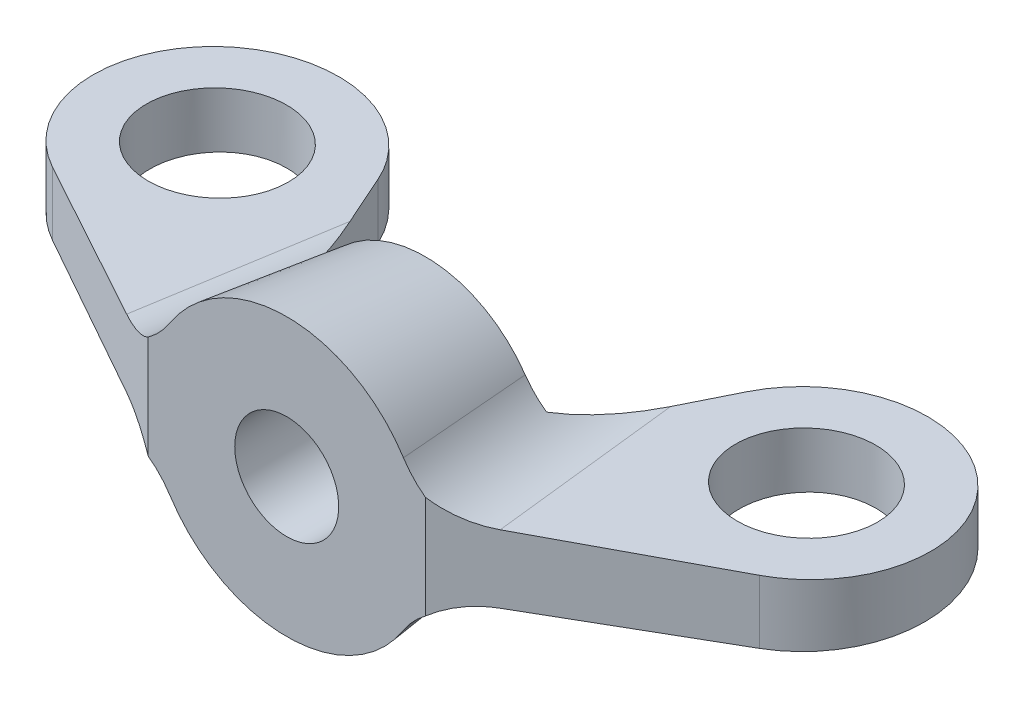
ISO-10303-21;
HEADER;
FILE_DESCRIPTION(('STEP AP214'),'2;1');
FILE_NAME('part.step','',(''),(''),'','','');
FILE_SCHEMA(('AUTOMOTIVE_DESIGN { 1 0 10303 214 1 1 1 1 }'));
ENDSEC;
DATA;
#1=APPLICATION_CONTEXT('core data for automotive mechanical design processes');
#2=APPLICATION_PROTOCOL_DEFINITION('international standard','automotive_design',2000,#1);
#3=PRODUCT_CONTEXT('',#1,'mechanical');
#4=PRODUCT('Part','Part','',(#3));
#5=PRODUCT_RELATED_PRODUCT_CATEGORY('part','',(#4));
#6=PRODUCT_DEFINITION_FORMATION('','',#4);
#7=PRODUCT_DEFINITION_CONTEXT('part definition',#1,'design');
#8=PRODUCT_DEFINITION('design','',#6,#7);
#9=PRODUCT_DEFINITION_SHAPE('','',#8);
#10=(LENGTH_UNIT() NAMED_UNIT(*) SI_UNIT(.MILLI.,.METRE.));
#11=(NAMED_UNIT(*) PLANE_ANGLE_UNIT() SI_UNIT($,.RADIAN.));
#12=(NAMED_UNIT(*) SI_UNIT($,.STERADIAN.) SOLID_ANGLE_UNIT());
#13=UNCERTAINTY_MEASURE_WITH_UNIT(LENGTH_MEASURE(1.E-05),#10,'distance_accuracy_value','');
#14=(GEOMETRIC_REPRESENTATION_CONTEXT(3) GLOBAL_UNCERTAINTY_ASSIGNED_CONTEXT((#13)) GLOBAL_UNIT_ASSIGNED_CONTEXT((#10,
#11,#12)) REPRESENTATION_CONTEXT('',''));
#15=CARTESIAN_POINT('',(0.,0.,0.));
#16=DIRECTION('',(0.,0.,1.));
#17=DIRECTION('',(1.,0.,0.));
#18=AXIS2_PLACEMENT_3D('',#15,#16,#17);
#19=CARTESIAN_POINT('',(0.,0.,0.));
#20=DIRECTION('',(0.,0.,1.));
#21=DIRECTION('',(1.,0.,0.));
#22=AXIS2_PLACEMENT_3D('',#19,#20,#21);
#23=PLANE('',#22);
#24=CARTESIAN_POINT('',(0.,0.,0.));
#25=DIRECTION('',(0.,0.,1.));
#26=DIRECTION('',(1.,0.,0.));
#27=AXIS2_PLACEMENT_3D('',#24,#25,#26);
#28=CIRCLE('',#27,1.5);
#29=CARTESIAN_POINT('',(-1.5,0.,0.));
#30=VERTEX_POINT('',#29);
#31=EDGE_CURVE('E705',#30,#30,#28,.T.);
#32=ORIENTED_EDGE('',*,*,#31,.F.);
#33=EDGE_LOOP('',(#32));
#34=FACE_BOUND('',#33,.T.);
#35=CARTESIAN_POINT('',(0.,0.,0.));
#36=DIRECTION('',(0.,0.,-1.));
#37=DIRECTION('',(-1.,0.,0.));
#38=AXIS2_PLACEMENT_3D('',#35,#36,#37);
#39=CIRCLE('',#38,4.);
#40=CARTESIAN_POINT('',(3.36924891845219,-2.155959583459,0.));
#41=VERTEX_POINT('',#40);
#42=CARTESIAN_POINT('',(-3.36924891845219,-2.155959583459,0.));
#43=VERTEX_POINT('',#42);
#44=EDGE_CURVE('E211',#41,#43,#39,.T.);
#45=ORIENTED_EDGE('',*,*,#44,.F.);
#46=CARTESIAN_POINT('',(6.64235905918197,-1.2202384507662,8.80953803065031));
#47=CARTESIAN_POINT('',(5.18750857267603,-1.22493701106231,8.99748044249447));
#48=CARTESIAN_POINT('',(4.47790141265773,-2.50744715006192,9.05714438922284));
#49=CARTESIAN_POINT('',(6.52382338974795,-1.19731375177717,7.89255007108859));
#50=CARTESIAN_POINT('',(5.07740379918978,-1.20202689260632,8.08107570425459));
#51=CARTESIAN_POINT('',(4.36540421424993,-2.47374135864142,8.14015642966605));
#52=CARTESIAN_POINT('',(6.40497381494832,-1.17439006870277,6.97560274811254));
#53=CARTESIAN_POINT('',(4.9672116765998,-1.17908785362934,7.16351414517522));
#54=CARTESIAN_POINT('',(4.25296369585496,-2.43955621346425,7.22320910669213));
#55=CARTESIAN_POINT('',(6.16651897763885,-1.1285451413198,5.14180565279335));
#56=CARTESIAN_POINT('',(4.74690083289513,-1.13320377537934,5.32815101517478));
#57=CARTESIAN_POINT('',(4.02824072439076,-2.37006878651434,5.38941201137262));
#58=CARTESIAN_POINT('',(6.04691371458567,-1.10562389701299,4.22495588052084));
#59=CARTESIAN_POINT('',(4.63681298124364,-1.11026523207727,4.4106092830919));
#60=CARTESIAN_POINT('',(3.91595827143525,-2.33476650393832,4.47256223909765));
#61=CARTESIAN_POINT('',(5.68677537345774,-1.03686496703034,1.47459868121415));
#62=CARTESIAN_POINT('',(4.30723804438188,-1.04156178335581,1.66247133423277));
#63=CARTESIAN_POINT('',(3.57941768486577,-2.22694714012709,1.72220503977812));
#64=CARTESIAN_POINT('',(5.44491724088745,-0.991031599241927,-0.358736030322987));
#65=CARTESIAN_POINT('',(4.08751339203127,-0.995716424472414,-0.171343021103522));
#66=CARTESIAN_POINT('',(3.35546394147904,-2.15251683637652,-0.11112967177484));
#67=CARTESIAN_POINT('',(5.0782014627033,-0.922294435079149,-3.10822259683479));
#68=CARTESIAN_POINT('',(3.75722449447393,-0.926760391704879,-2.92958433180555));
#69=CARTESIAN_POINT('',(3.02064372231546,-2.03563344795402,-2.86061623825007));
#70=CARTESIAN_POINT('',(4.95530756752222,-0.899384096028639,-4.02463615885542));
#71=CARTESIAN_POINT('',(3.64742245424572,-0.903829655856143,-3.84681376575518));
#72=CARTESIAN_POINT('',(2.9092215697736,-1.99579914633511,-3.77702980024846));
#73=CARTESIAN_POINT('',(4.70786946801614,-0.853569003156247,-5.85723987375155));
#74=CARTESIAN_POINT('',(3.4277997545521,-0.857960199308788,-5.68159202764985));
#75=CARTESIAN_POINT('',(2.68689113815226,-1.91404817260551,-5.60963351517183));
#76=CARTESIAN_POINT('',(4.58332526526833,-0.830664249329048,-6.77343002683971));
#77=CARTESIAN_POINT('',(3.31803384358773,-0.83503293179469,-6.598682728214));
#78=CARTESIAN_POINT('',(2.57598285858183,-1.87213150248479,-6.52582366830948));
#79=CARTESIAN_POINT('',(4.33216173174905,-0.784861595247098,-8.60553619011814));
#80=CARTESIAN_POINT('',(3.09841950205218,-0.789171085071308,-8.43315659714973));
#81=CARTESIAN_POINT('',(2.35486126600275,-1.78582076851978,-8.35792983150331));
#82=CARTESIAN_POINT('',(4.20554238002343,-0.761963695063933,-9.52145219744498));
#83=CARTESIAN_POINT('',(2.98863539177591,-0.766249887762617,-9.35000448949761));
#84=CARTESIAN_POINT('',(2.2446479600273,-1.74142667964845,-9.27384583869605));
#85=CARTESIAN_POINT('',(3.94953283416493,-0.71617750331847,-11.352899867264));
#86=CARTESIAN_POINT('',(2.76881328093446,-0.720396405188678,-11.1841437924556));
#87=CARTESIAN_POINT('',(2.02522316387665,-1.64961003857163,-11.1052935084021));
#88=CARTESIAN_POINT('',(3.82014263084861,-0.693289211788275,-12.268431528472));
#89=CARTESIAN_POINT('',(2.65885330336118,-0.697480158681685,-12.1007936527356));
#90=CARTESIAN_POINT('',(1.9160116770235,-1.60218747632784,-12.0208251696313));
#91=CARTESIAN_POINT('',(3.68901894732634,-0.670407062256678,-13.1837175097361));
#92=CARTESIAN_POINT('',(2.54837143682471,-0.674491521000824,-13.0203391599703));
#93=CARTESIAN_POINT('',(1.80745432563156,-1.55297509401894,-12.9361111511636));
#94=(BOUNDED_SURFACE() B_SPLINE_SURFACE(3,2,((#46,#47,#48),(#49,#50,#51),(#52,#53,#54),(#55,#56,
#57),(#58,#59,#60),(#61,#62,#63),(#64,#65,#66),(#67,#68,#69),(#70,#71,#72),(#73,#74,#75),(#76,
#77,#78),(#79,#80,#81),(#82,#83,#84),(#85,#86,#87),(#88,#89,#90),(#91,#92,#93)),.UNSPECIFIED.,
.F.,.F.,.F.) B_SPLINE_SURFACE_WITH_KNOTS((4,2,2,2,2,2,2,4),(3,3),(0.,2.77470483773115,
5.54941167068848,11.0987666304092,13.8734680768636,16.6481668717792,19.4228937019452,
22.1976297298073),(0.,1.),
.UNSPECIFIED.) GEOMETRIC_REPRESENTATION_ITEM() RATIONAL_B_SPLINE_SURFACE(((1.,0.86248264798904,
1.),(1.,0.863732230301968,1.),(1.,0.865034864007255,1.),(1.,0.867762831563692,1.),(1.,
0.869188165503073,1.),(1.,0.873673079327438,1.),(1.,0.8769415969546,1.),(1.,0.882407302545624,
1.),(1.,0.884323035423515,1.),(1.,0.888376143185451,1.),(1.,0.890513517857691,1.),(1.,
0.895049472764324,1.),(1.,0.897448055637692,1.),(1.,0.90256065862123,1.),(1.,0.905274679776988,
1.),(1.,0.908173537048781,1.))) REPRESENTATION_ITEM('') SURFACE());
#95=CARTESIAN_POINT('',(3.36924891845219,-2.155959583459,0.));
#96=CARTESIAN_POINT('',(3.41100760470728,-2.09069104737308,0.));
#97=CARTESIAN_POINT('',(3.4558298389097,-2.02738658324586,0.));
#98=CARTESIAN_POINT('',(3.55076075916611,-1.90573950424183,0.));
#99=CARTESIAN_POINT('',(3.60082121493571,-1.84735925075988,0.));
#100=CARTESIAN_POINT('',(3.70611327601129,-1.735466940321,0.));
#101=CARTESIAN_POINT('',(3.76134483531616,-1.68195484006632,0.));
#102=CARTESIAN_POINT('',(3.87698149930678,-1.57978975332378,0.));
#103=CARTESIAN_POINT('',(3.93742693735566,-1.53118241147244,0.));
#104=CARTESIAN_POINT('',(4.00000000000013,-1.48548811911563,0.));
#105=B_SPLINE_CURVE_WITH_KNOTS('',3,(#95,#96,#97,#98,#99,#100,#101,#102,#103,#104),
.UNSPECIFIED.,.F.,.F.,(4,2,2,2,4),(0.,0.232362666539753,0.462748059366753,0.693131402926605,
0.925491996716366),.UNSPECIFIED.);
#106=CARTESIAN_POINT('',(4.,-1.48548811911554,0.));
#107=VERTEX_POINT('',#106);
#108=EDGE_CURVE('E302',#41,#107,#105,.T.);
#109=ORIENTED_EDGE('',*,*,#108,.T.);
#110=DIRECTION('',(0.,1.,0.));
#111=VECTOR('',#110,1.);
#112=CARTESIAN_POINT('',(4.,-4.000025,0.));
#113=LINE('',#112,#111);
#114=CARTESIAN_POINT('',(4.,1.48548811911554,0.));
#115=VERTEX_POINT('',#114);
#116=EDGE_CURVE('E72',#107,#115,#113,.T.);
#117=ORIENTED_EDGE('',*,*,#116,.T.);
#118=CARTESIAN_POINT('',(4.47790141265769,2.50744715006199,9.05714438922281));
#119=CARTESIAN_POINT('',(5.18750857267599,1.22493701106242,8.99748044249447));
#120=CARTESIAN_POINT('',(6.64235905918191,1.22023845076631,8.80953803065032));
#121=CARTESIAN_POINT('',(4.36540421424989,2.47374135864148,8.14015642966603));
#122=CARTESIAN_POINT('',(5.07740379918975,1.20202689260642,8.08107570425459));
#123=CARTESIAN_POINT('',(6.52382338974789,1.19731375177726,7.8925500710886));
#124=CARTESIAN_POINT('',(4.25296369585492,2.4395562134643,7.22320910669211));
#125=CARTESIAN_POINT('',(4.96721167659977,1.17908785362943,7.16351414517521));
#126=CARTESIAN_POINT('',(6.40497381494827,1.17439006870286,6.97560274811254));
#127=CARTESIAN_POINT('',(4.02824072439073,2.37006878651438,5.3894120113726));
#128=CARTESIAN_POINT('',(4.74690083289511,1.1332037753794,5.32815101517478));
#129=CARTESIAN_POINT('',(6.16651897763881,1.12854514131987,5.14180565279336));
#130=CARTESIAN_POINT('',(3.91595827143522,2.33476650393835,4.47256223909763));
#131=CARTESIAN_POINT('',(4.63681298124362,1.11026523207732,4.41060928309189));
#132=CARTESIAN_POINT('',(6.04691371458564,1.10562389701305,4.22495588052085));
#133=CARTESIAN_POINT('',(3.57941768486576,2.2269471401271,1.7222050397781));
#134=CARTESIAN_POINT('',(4.30723804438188,1.04156178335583,1.66247133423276));
#135=CARTESIAN_POINT('',(5.68677537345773,1.03686496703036,1.47459868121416));
#136=CARTESIAN_POINT('',(3.35546394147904,2.15251683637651,-0.111129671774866));
#137=CARTESIAN_POINT('',(4.08751339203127,0.99571642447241,-0.171343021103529));
#138=CARTESIAN_POINT('',(5.44491724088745,0.991031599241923,-0.35873603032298));
#139=CARTESIAN_POINT('',(3.02064372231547,2.03563344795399,-2.8606162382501));
#140=CARTESIAN_POINT('',(3.75722449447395,0.926760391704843,-2.92958433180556));
#141=CARTESIAN_POINT('',(5.07820146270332,0.922294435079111,-3.10822259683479));
#142=CARTESIAN_POINT('',(2.90922156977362,1.99579914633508,-3.77702980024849));
#143=CARTESIAN_POINT('',(3.64742245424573,0.903829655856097,-3.84681376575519));
#144=CARTESIAN_POINT('',(4.95530756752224,0.89938409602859,-4.02463615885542));
#145=CARTESIAN_POINT('',(2.68689113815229,1.91404817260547,-5.60963351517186));
#146=CARTESIAN_POINT('',(3.42779975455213,0.857960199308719,-5.68159202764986));
#147=CARTESIAN_POINT('',(4.70786946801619,0.853569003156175,-5.85723987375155));
#148=CARTESIAN_POINT('',(2.57598285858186,1.87213150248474,-6.52582366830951));
#149=CARTESIAN_POINT('',(3.31803384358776,0.83503293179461,-6.59868272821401));
#150=CARTESIAN_POINT('',(4.58332526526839,0.830664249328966,-6.77343002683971));
#151=CARTESIAN_POINT('',(2.35486126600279,1.78582076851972,-8.35792983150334));
#152=CARTESIAN_POINT('',(3.09841950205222,0.789171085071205,-8.43315659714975));
#153=CARTESIAN_POINT('',(4.33216173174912,0.784861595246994,-8.60553619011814));
#154=CARTESIAN_POINT('',(2.24464796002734,1.74142667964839,-9.27384583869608));
#155=CARTESIAN_POINT('',(2.98863539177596,0.766249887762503,-9.35000448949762));
#156=CARTESIAN_POINT('',(4.20554238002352,0.761963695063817,-9.52145219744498));
#157=CARTESIAN_POINT('',(2.02522316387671,1.64961003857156,-11.1052935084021));
#158=CARTESIAN_POINT('',(2.76881328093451,0.720396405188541,-11.1841437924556));
#159=CARTESIAN_POINT('',(3.94953283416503,0.716177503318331,-11.352899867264));
#160=CARTESIAN_POINT('',(1.91601167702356,1.60218747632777,-12.0208251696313));
#161=CARTESIAN_POINT('',(2.65885330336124,0.697480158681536,-12.1007936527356));
#162=CARTESIAN_POINT('',(3.82014263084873,0.693289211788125,-12.268431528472));
#163=CARTESIAN_POINT('',(1.80745432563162,1.55297509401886,-12.9361111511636));
#164=CARTESIAN_POINT('',(2.54837143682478,0.674491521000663,-13.0203391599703));
#165=CARTESIAN_POINT('',(3.68901894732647,0.670407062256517,-13.1837175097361));
#166=(BOUNDED_SURFACE() B_SPLINE_SURFACE(3,2,((#118,#119,#120),(#121,#122,#123),(#124,#125,
#126),(#127,#128,#129),(#130,#131,#132),(#133,#134,#135),(#136,#137,#138),(#139,#140,#141),
(#142,#143,#144),(#145,#146,#147),(#148,#149,#150),(#151,#152,#153),(#154,#155,#156),(#157,#158,
#159),(#160,#161,#162),(#163,#164,#165)),.UNSPECIFIED.,.F.,.F.,
.F.) B_SPLINE_SURFACE_WITH_KNOTS((4,2,2,2,2,2,2,4),(3,3),(0.,2.77470483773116,5.54941167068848,
11.0987666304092,13.8734680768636,16.6481668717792,19.4228937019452,22.1976297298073),(0.,1.),
.UNSPECIFIED.) GEOMETRIC_REPRESENTATION_ITEM() RATIONAL_B_SPLINE_SURFACE(((1.,0.862482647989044,
1.),(1.,0.863732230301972,1.),(1.,0.865034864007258,1.),(1.,0.867762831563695,1.),(1.,
0.869188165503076,1.),(1.,0.873673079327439,1.),(1.,0.8769415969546,1.),(1.,0.882407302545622,
1.),(1.,0.884323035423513,1.),(1.,0.888376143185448,1.),(1.,0.890513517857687,1.),(1.,
0.895049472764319,1.),(1.,0.897448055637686,1.),(1.,0.902560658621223,1.),(1.,0.905274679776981,
1.),(1.,0.908173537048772,1.))) REPRESENTATION_ITEM('') SURFACE());
#167=CARTESIAN_POINT('',(4.,1.48548811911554,0.));
#168=CARTESIAN_POINT('',(3.93742693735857,1.53118241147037,0.));
#169=CARTESIAN_POINT('',(3.87698149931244,1.57978975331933,0.));
#170=CARTESIAN_POINT('',(3.76134483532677,1.68195484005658,0.));
#171=CARTESIAN_POINT('',(3.70611327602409,1.73546694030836,0.));
#172=CARTESIAN_POINT('',(3.60082121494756,1.84735925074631,0.));
#173=CARTESIAN_POINT('',(3.55076075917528,1.90573950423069,0.));
#174=CARTESIAN_POINT('',(3.45582983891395,2.02738658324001,0.));
#175=CARTESIAN_POINT('',(3.4110076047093,2.0906910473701,0.));
#176=CARTESIAN_POINT('',(3.36924891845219,2.155959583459,0.));
#177=B_SPLINE_CURVE_WITH_KNOTS('',3,(#167,#168,#169,#170,#171,#172,#173,#174,#175,#176),
.UNSPECIFIED.,.F.,.F.,(4,2,2,2,4),(0.,0.232360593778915,0.462743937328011,0.693129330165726,
0.925491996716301),.UNSPECIFIED.);
#178=CARTESIAN_POINT('',(3.36924891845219,2.155959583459,0.));
#179=VERTEX_POINT('',#178);
#180=EDGE_CURVE('E12',#115,#179,#177,.T.);
#181=ORIENTED_EDGE('',*,*,#180,.T.);
#182=CARTESIAN_POINT('',(-3.36924891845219,2.155959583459,0.));
#183=VERTEX_POINT('',#182);
#184=EDGE_CURVE('E634',#183,#179,#39,.T.);
#185=ORIENTED_EDGE('',*,*,#184,.F.);
#186=CARTESIAN_POINT('',(-6.64235905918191,1.22023845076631,8.80953803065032));
#187=CARTESIAN_POINT('',(-5.18750857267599,1.22493701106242,8.99748044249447));
#188=CARTESIAN_POINT('',(-4.47790141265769,2.50744715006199,9.05714438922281));
#189=CARTESIAN_POINT('',(-6.52382338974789,1.19731375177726,7.8925500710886));
#190=CARTESIAN_POINT('',(-5.07740379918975,1.20202689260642,8.08107570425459));
#191=CARTESIAN_POINT('',(-4.36540421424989,2.47374135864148,8.14015642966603));
#192=CARTESIAN_POINT('',(-6.40497381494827,1.17439006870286,6.97560274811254));
#193=CARTESIAN_POINT('',(-4.96721167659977,1.17908785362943,7.16351414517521));
#194=CARTESIAN_POINT('',(-4.25296369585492,2.4395562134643,7.22320910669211));
#195=CARTESIAN_POINT('',(-6.16651897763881,1.12854514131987,5.14180565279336));
#196=CARTESIAN_POINT('',(-4.74690083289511,1.1332037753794,5.32815101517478));
#197=CARTESIAN_POINT('',(-4.02824072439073,2.37006878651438,5.3894120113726));
#198=CARTESIAN_POINT('',(-6.04691371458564,1.10562389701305,4.22495588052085));
#199=CARTESIAN_POINT('',(-4.63681298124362,1.11026523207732,4.41060928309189));
#200=CARTESIAN_POINT('',(-3.91595827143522,2.33476650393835,4.47256223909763));
#201=CARTESIAN_POINT('',(-5.68677537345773,1.03686496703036,1.47459868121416));
#202=CARTESIAN_POINT('',(-4.30723804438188,1.04156178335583,1.66247133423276));
#203=CARTESIAN_POINT('',(-3.57941768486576,2.2269471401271,1.7222050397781));
#204=CARTESIAN_POINT('',(-5.44491724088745,0.991031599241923,-0.358736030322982));
#205=CARTESIAN_POINT('',(-4.08751339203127,0.995716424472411,-0.17134302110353));
#206=CARTESIAN_POINT('',(-3.35546394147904,2.15251683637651,-0.111129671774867));
#207=CARTESIAN_POINT('',(-5.07820146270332,0.922294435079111,-3.10822259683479));
#208=CARTESIAN_POINT('',(-3.75722449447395,0.926760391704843,-2.92958433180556));
#209=CARTESIAN_POINT('',(-3.02064372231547,2.03563344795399,-2.8606162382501));
#210=CARTESIAN_POINT('',(-4.95530756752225,0.89938409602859,-4.02463615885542));
#211=CARTESIAN_POINT('',(-3.64742245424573,0.903829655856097,-3.84681376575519));
#212=CARTESIAN_POINT('',(-2.90922156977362,1.99579914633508,-3.77702980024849));
#213=CARTESIAN_POINT('',(-4.70786946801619,0.853569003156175,-5.85723987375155));
#214=CARTESIAN_POINT('',(-3.42779975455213,0.857960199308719,-5.68159202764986));
#215=CARTESIAN_POINT('',(-2.68689113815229,1.91404817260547,-5.60963351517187));
#216=CARTESIAN_POINT('',(-4.58332526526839,0.830664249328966,-6.77343002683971));
#217=CARTESIAN_POINT('',(-3.31803384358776,0.83503293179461,-6.59868272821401));
#218=CARTESIAN_POINT('',(-2.57598285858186,1.87213150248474,-6.52582366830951));
#219=CARTESIAN_POINT('',(-4.33216173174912,0.784861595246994,-8.60553619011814));
#220=CARTESIAN_POINT('',(-3.09841950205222,0.789171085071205,-8.43315659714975));
#221=CARTESIAN_POINT('',(-2.35486126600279,1.78582076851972,-8.35792983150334));
#222=CARTESIAN_POINT('',(-4.20554238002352,0.761963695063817,-9.52145219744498));
#223=CARTESIAN_POINT('',(-2.98863539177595,0.766249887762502,-9.35000448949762));
#224=CARTESIAN_POINT('',(-2.24464796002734,1.74142667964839,-9.27384583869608));
#225=CARTESIAN_POINT('',(-3.94953283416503,0.716177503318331,-11.352899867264));
#226=CARTESIAN_POINT('',(-2.76881328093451,0.72039640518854,-11.1841437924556));
#227=CARTESIAN_POINT('',(-2.02522316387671,1.64961003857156,-11.1052935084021));
#228=CARTESIAN_POINT('',(-3.82014263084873,0.693289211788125,-12.268431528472));
#229=CARTESIAN_POINT('',(-2.65885330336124,0.697480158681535,-12.1007936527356));
#230=CARTESIAN_POINT('',(-1.91601167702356,1.60218747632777,-12.0208251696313));
#231=CARTESIAN_POINT('',(-3.68901894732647,0.670407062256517,-13.1837175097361));
#232=CARTESIAN_POINT('',(-2.54837143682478,0.674491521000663,-13.0203391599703));
#233=CARTESIAN_POINT('',(-1.80745432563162,1.55297509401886,-12.9361111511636));
#234=(BOUNDED_SURFACE() B_SPLINE_SURFACE(3,2,((#186,#187,#188),(#189,#190,#191),(#192,#193,
#194),(#195,#196,#197),(#198,#199,#200),(#201,#202,#203),(#204,#205,#206),(#207,#208,#209),
(#210,#211,#212),(#213,#214,#215),(#216,#217,#218),(#219,#220,#221),(#222,#223,#224),(#225,#226,
#227),(#228,#229,#230),(#231,#232,#233)),.UNSPECIFIED.,.F.,.F.,
.F.) B_SPLINE_SURFACE_WITH_KNOTS((4,2,2,2,2,2,2,4),(3,3),(0.,2.77470483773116,5.54941167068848,
11.0987666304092,13.8734680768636,16.6481668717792,19.4228937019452,22.1976297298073),(0.,1.),
.UNSPECIFIED.) GEOMETRIC_REPRESENTATION_ITEM() RATIONAL_B_SPLINE_SURFACE(((1.,0.862482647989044,
1.),(1.,0.863732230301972,1.),(1.,0.865034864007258,1.),(1.,0.867762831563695,1.),(1.,
0.869188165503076,1.),(1.,0.873673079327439,1.),(1.,0.8769415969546,1.),(1.,0.882407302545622,
1.),(1.,0.884323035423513,1.),(1.,0.888376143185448,1.),(1.,0.890513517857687,1.),(1.,
0.895049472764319,1.),(1.,0.897448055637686,1.),(1.,0.902560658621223,1.),(1.,0.905274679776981,
1.),(1.,0.908173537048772,1.))) REPRESENTATION_ITEM('') SURFACE());
#235=CARTESIAN_POINT('',(-3.36924891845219,2.155959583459,0.));
#236=CARTESIAN_POINT('',(-3.41100760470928,2.09069104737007,0.));
#237=CARTESIAN_POINT('',(-3.45582983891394,2.02738658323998,0.));
#238=CARTESIAN_POINT('',(-3.55076075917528,1.90573950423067,0.));
#239=CARTESIAN_POINT('',(-3.60082121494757,1.8473592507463,0.));
#240=CARTESIAN_POINT('',(-3.70611327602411,1.73546694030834,0.));
#241=CARTESIAN_POINT('',(-3.76134483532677,1.68195484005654,0.));
#242=CARTESIAN_POINT('',(-3.87698149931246,1.57978975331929,0.));
#243=CARTESIAN_POINT('',(-3.93742693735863,1.53118241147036,0.));
#244=CARTESIAN_POINT('',(-4.00000000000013,1.48548811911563,0.));
#245=B_SPLINE_CURVE_WITH_KNOTS('',3,(#235,#236,#237,#238,#239,#240,#241,#242,#243,#244),
.UNSPECIFIED.,.F.,.F.,(4,2,2,2,4),(0.,0.232362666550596,0.462748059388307,0.693131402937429,
0.925491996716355),.UNSPECIFIED.);
#246=CARTESIAN_POINT('',(-4.,1.48548811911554,0.));
#247=VERTEX_POINT('',#246);
#248=EDGE_CURVE('E328',#183,#247,#245,.T.);
#249=ORIENTED_EDGE('',*,*,#248,.T.);
#250=DIRECTION('',(0.,1.,0.));
#251=VECTOR('',#250,1.);
#252=CARTESIAN_POINT('',(-4.,-4.000025,0.));
#253=LINE('',#252,#251);
#254=CARTESIAN_POINT('',(-4.,-1.48548811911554,0.));
#255=VERTEX_POINT('',#254);
#256=EDGE_CURVE('E632',#255,#247,#253,.T.);
#257=ORIENTED_EDGE('',*,*,#256,.F.);
#258=CARTESIAN_POINT('',(-4.47790141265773,-2.50744715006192,9.05714438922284));
#259=CARTESIAN_POINT('',(-5.18750857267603,-1.22493701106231,8.99748044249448));
#260=CARTESIAN_POINT('',(-6.64235905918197,-1.2202384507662,8.80953803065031));
#261=CARTESIAN_POINT('',(-4.36540421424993,-2.47374135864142,8.14015642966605));
#262=CARTESIAN_POINT('',(-5.07740379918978,-1.20202689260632,8.0810757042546));
#263=CARTESIAN_POINT('',(-6.52382338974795,-1.19731375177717,7.8925500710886));
#264=CARTESIAN_POINT('',(-4.25296369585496,-2.43955621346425,7.22320910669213));
#265=CARTESIAN_POINT('',(-4.9672116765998,-1.17908785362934,7.16351414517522));
#266=CARTESIAN_POINT('',(-6.40497381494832,-1.17439006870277,6.97560274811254));
#267=CARTESIAN_POINT('',(-4.02824072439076,-2.37006878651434,5.38941201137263));
#268=CARTESIAN_POINT('',(-4.74690083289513,-1.13320377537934,5.32815101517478));
#269=CARTESIAN_POINT('',(-6.16651897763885,-1.1285451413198,5.14180565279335));
#270=CARTESIAN_POINT('',(-3.91595827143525,-2.33476650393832,4.47256223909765));
#271=CARTESIAN_POINT('',(-4.63681298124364,-1.11026523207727,4.4106092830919));
#272=CARTESIAN_POINT('',(-6.04691371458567,-1.10562389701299,4.22495588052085));
#273=CARTESIAN_POINT('',(-3.57941768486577,-2.22694714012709,1.72220503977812));
#274=CARTESIAN_POINT('',(-4.30723804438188,-1.04156178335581,1.66247133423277));
#275=CARTESIAN_POINT('',(-5.68677537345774,-1.03686496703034,1.47459868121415));
#276=CARTESIAN_POINT('',(-3.35546394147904,-2.15251683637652,-0.111129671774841));
#277=CARTESIAN_POINT('',(-4.08751339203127,-0.995716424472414,-0.171343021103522));
#278=CARTESIAN_POINT('',(-5.44491724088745,-0.991031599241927,-0.358736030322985));
#279=CARTESIAN_POINT('',(-3.02064372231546,-2.03563344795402,-2.86061623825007));
#280=CARTESIAN_POINT('',(-3.75722449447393,-0.926760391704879,-2.92958433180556));
#281=CARTESIAN_POINT('',(-5.0782014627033,-0.922294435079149,-3.10822259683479));
#282=CARTESIAN_POINT('',(-2.9092215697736,-1.99579914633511,-3.77702980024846));
#283=CARTESIAN_POINT('',(-3.64742245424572,-0.903829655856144,-3.84681376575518));
#284=CARTESIAN_POINT('',(-4.95530756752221,-0.899384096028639,-4.02463615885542));
#285=CARTESIAN_POINT('',(-2.68689113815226,-1.91404817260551,-5.60963351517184));
#286=CARTESIAN_POINT('',(-3.4277997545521,-0.857960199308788,-5.68159202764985));
#287=CARTESIAN_POINT('',(-4.70786946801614,-0.853569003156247,-5.85723987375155));
#288=CARTESIAN_POINT('',(-2.57598285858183,-1.87213150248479,-6.52582366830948));
#289=CARTESIAN_POINT('',(-3.31803384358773,-0.83503293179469,-6.598682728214));
#290=CARTESIAN_POINT('',(-4.58332526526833,-0.830664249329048,-6.77343002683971));
#291=CARTESIAN_POINT('',(-2.35486126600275,-1.78582076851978,-8.35792983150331));
#292=CARTESIAN_POINT('',(-3.09841950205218,-0.789171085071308,-8.43315659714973));
#293=CARTESIAN_POINT('',(-4.33216173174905,-0.784861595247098,-8.60553619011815));
#294=CARTESIAN_POINT('',(-2.2446479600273,-1.74142667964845,-9.27384583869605));
#295=CARTESIAN_POINT('',(-2.98863539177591,-0.766249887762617,-9.35000448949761));
#296=CARTESIAN_POINT('',(-4.20554238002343,-0.761963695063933,-9.52145219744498));
#297=CARTESIAN_POINT('',(-2.02522316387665,-1.64961003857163,-11.1052935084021));
#298=CARTESIAN_POINT('',(-2.76881328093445,-0.720396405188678,-11.1841437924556));
#299=CARTESIAN_POINT('',(-3.94953283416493,-0.71617750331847,-11.352899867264));
#300=CARTESIAN_POINT('',(-1.9160116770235,-1.60218747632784,-12.0208251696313));
#301=CARTESIAN_POINT('',(-2.65885330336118,-0.697480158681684,-12.1007936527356));
#302=CARTESIAN_POINT('',(-3.82014263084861,-0.693289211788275,-12.268431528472));
#303=CARTESIAN_POINT('',(-1.80745432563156,-1.55297509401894,-12.9361111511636));
#304=CARTESIAN_POINT('',(-2.54837143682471,-0.674491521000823,-13.0203391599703));
#305=CARTESIAN_POINT('',(-3.68901894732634,-0.670407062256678,-13.1837175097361));
#306=(BOUNDED_SURFACE() B_SPLINE_SURFACE(3,2,((#258,#259,#260),(#261,#262,#263),(#264,#265,
#266),(#267,#268,#269),(#270,#271,#272),(#273,#274,#275),(#276,#277,#278),(#279,#280,#281),
(#282,#283,#284),(#285,#286,#287),(#288,#289,#290),(#291,#292,#293),(#294,#295,#296),(#297,#298,
#299),(#300,#301,#302),(#303,#304,#305)),.UNSPECIFIED.,.F.,.F.,
.F.) B_SPLINE_SURFACE_WITH_KNOTS((4,2,2,2,2,2,2,4),(3,3),(0.,2.77470483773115,5.54941167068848,
11.0987666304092,13.8734680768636,16.6481668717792,19.4228937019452,22.1976297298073),(0.,1.),
.UNSPECIFIED.) GEOMETRIC_REPRESENTATION_ITEM() RATIONAL_B_SPLINE_SURFACE(((1.,0.86248264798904,
1.),(1.,0.863732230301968,1.),(1.,0.865034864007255,1.),(1.,0.867762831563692,1.),(1.,
0.869188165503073,1.),(1.,0.873673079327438,1.),(1.,0.8769415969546,1.),(1.,0.882407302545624,
1.),(1.,0.884323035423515,1.),(1.,0.888376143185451,1.),(1.,0.890513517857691,1.),(1.,
0.895049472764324,1.),(1.,0.897448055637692,1.),(1.,0.90256065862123,1.),(1.,0.905274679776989,
1.),(1.,0.908173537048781,1.))) REPRESENTATION_ITEM('') SURFACE());
#307=CARTESIAN_POINT('',(-4.,-1.48548811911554,0.));
#308=CARTESIAN_POINT('',(-3.93742693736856,-1.53118241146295,0.));
#309=CARTESIAN_POINT('',(-3.87698149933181,-1.57978975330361,0.));
#310=CARTESIAN_POINT('',(-3.76134483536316,-1.68195484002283,0.));
#311=CARTESIAN_POINT('',(-3.70611327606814,-1.73546694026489,0.));
#312=CARTESIAN_POINT('',(-3.60082121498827,-1.84735925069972,0.));
#313=CARTESIAN_POINT('',(-3.55076075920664,-1.90573950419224,0.));
#314=CARTESIAN_POINT('',(-3.45582983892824,-2.02738658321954,0.));
#315=CARTESIAN_POINT('',(-3.41100760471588,-2.0906910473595,0.));
#316=CARTESIAN_POINT('',(-3.36924891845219,-2.155959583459,0.));
#317=B_SPLINE_CURVE_WITH_KNOTS('',3,(#307,#308,#309,#310,#311,#312,#313,#314,#315,#316),
.UNSPECIFIED.,.F.,.F.,(4,2,2,2,4),(0.,0.23236059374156,0.462743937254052,0.693129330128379,
0.92549199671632),.UNSPECIFIED.);
#318=EDGE_CURVE('E335',#255,#43,#317,.T.);
#319=ORIENTED_EDGE('',*,*,#318,.T.);
#320=EDGE_LOOP('',(#45,#109,#117,#181,#185,#249,#257,#319));
#321=FACE_BOUND('',#320,.T.);
#322=ADVANCED_FACE('F56',(#34,#321),#23,.T.);
#323=CARTESIAN_POINT('',(12.,1.,0.));
#324=DIRECTION('',(0.,-0.999687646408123,0.0249921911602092));
#325=DIRECTION('',(0.,-0.0249921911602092,-0.999687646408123));
#326=AXIS2_PLACEMENT_3D('',#323,#324,#325);
#327=PLANE('',#326);
#328=CARTESIAN_POINT('',(8.5,0.837499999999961,-6.5));
#329=DIRECTION('',(0.,-0.999687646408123,0.0249921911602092));
#330=DIRECTION('',(0.,0.0249921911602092,0.999687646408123));
#331=AXIS2_PLACEMENT_3D('',#328,#329,#330);
#332=ELLIPSE('',#331,2.00062490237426,2.);
#333=CARTESIAN_POINT('',(8.5,0.887499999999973,-4.5));
#334=VERTEX_POINT('',#333);
#335=EDGE_CURVE('E748',#334,#334,#332,.T.);
#336=ORIENTED_EDGE('',*,*,#335,.T.);
#337=EDGE_LOOP('',(#336));
#338=FACE_BOUND('',#337,.T.);
#339=DIRECTION('',(0.417316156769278,-0.0227119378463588,-0.908477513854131));
#340=VECTOR('',#339,1.);
#341=CARTESIAN_POINT('',(3.46286140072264,0.902021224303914,-3.9191510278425));
#342=LINE('',#341,#340);
#343=CARTESIAN_POINT('',(4.62667125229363,0.838682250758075,-6.45270996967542));
#344=VERTEX_POINT('',#343);
#345=CARTESIAN_POINT('',(5.31950829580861,0.800975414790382,-7.96098340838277));
#346=VERTEX_POINT('',#345);
#347=EDGE_CURVE('E187',#344,#346,#342,.T.);
#348=ORIENTED_EDGE('',*,*,#347,.F.);
#349=CARTESIAN_POINT('',(3.68901894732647,0.670407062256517,-13.1837175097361));
#350=CARTESIAN_POINT('',(3.82014263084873,0.693289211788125,-12.268431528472));
#351=CARTESIAN_POINT('',(3.94953283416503,0.716177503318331,-11.352899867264));
#352=CARTESIAN_POINT('',(4.20554238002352,0.761963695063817,-9.52145219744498));
#353=CARTESIAN_POINT('',(4.33216173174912,0.784861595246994,-8.60553619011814));
#354=CARTESIAN_POINT('',(4.58332526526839,0.830664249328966,-6.77343002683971));
#355=CARTESIAN_POINT('',(4.70786946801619,0.853569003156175,-5.85723987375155));
#356=CARTESIAN_POINT('',(4.95530756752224,0.89938409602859,-4.02463615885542));
#357=CARTESIAN_POINT('',(5.07820146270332,0.922294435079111,-3.10822259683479));
#358=CARTESIAN_POINT('',(5.44491724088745,0.991031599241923,-0.35873603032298));
#359=CARTESIAN_POINT('',(5.68677537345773,1.03686496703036,1.47459868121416));
#360=CARTESIAN_POINT('',(6.04691371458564,1.10562389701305,4.22495588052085));
#361=CARTESIAN_POINT('',(6.16651897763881,1.12854514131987,5.14180565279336));
#362=CARTESIAN_POINT('',(6.40497381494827,1.17439006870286,6.97560274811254));
#363=CARTESIAN_POINT('',(6.52382338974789,1.19731375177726,7.8925500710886));
#364=CARTESIAN_POINT('',(6.64235905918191,1.22023845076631,8.80953803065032));
#365=B_SPLINE_CURVE_WITH_KNOTS('',3,(#349,#350,#351,#352,#353,#354,#355,#356,#357,#358,#359,
#360,#361,#362,#363,#364),.UNSPECIFIED.,.F.,.F.,(4,2,2,2,2,2,2,4),(0.,2.7747360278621,
5.54946285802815,8.32416165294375,11.0988630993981,16.6482180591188,19.4229248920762,
22.1976297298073),.UNSPECIFIED.);
#366=CARTESIAN_POINT('',(5.38940145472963,0.980724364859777,-0.771025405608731));
#367=VERTEX_POINT('',#366);
#368=EDGE_CURVE('E296',#344,#367,#365,.T.);
#369=ORIENTED_EDGE('',*,*,#368,.T.);
#370=DIRECTION('',(-0.874323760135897,0.0121297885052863,0.485191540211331));
#371=VECTOR('',#370,1.);
#372=CARTESIAN_POINT('',(10.1155363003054,0.91515710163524,-3.39371593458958));
#373=LINE('',#372,#371);
#374=CARTESIAN_POINT('',(10.1982953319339,0.914008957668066,-3.43964169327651));
#375=VERTEX_POINT('',#374);
#376=EDGE_CURVE('E716',#375,#367,#373,.T.);
#377=ORIENTED_EDGE('',*,*,#376,.F.);
#378=CARTESIAN_POINT('',(8.5,0.83749999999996,-6.5));
#379=DIRECTION('',(0.,-0.999687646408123,0.0249921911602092));
#380=DIRECTION('',(0.,0.0249921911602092,0.999687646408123));
#381=AXIS2_PLACEMENT_3D('',#378,#379,#380);
#382=ELLIPSE('',#381,3.50109357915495,3.5);
#383=EDGE_CURVE('E715',#346,#375,#382,.T.);
#384=ORIENTED_EDGE('',*,*,#383,.F.);
#385=EDGE_LOOP('',(#348,#369,#377,#384));
#386=FACE_BOUND('',#385,.T.);
#387=ADVANCED_FACE('F286',(#338,#386),#327,.F.);
#388=CARTESIAN_POINT('',(0.,-1.,0.));
#389=DIRECTION('',(0.,0.999687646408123,0.024992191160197));
#390=DIRECTION('',(0.,-0.024992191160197,0.999687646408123));
#391=AXIS2_PLACEMENT_3D('',#388,#389,#390);
#392=PLANE('',#391);
#393=CARTESIAN_POINT('',(8.5,-0.83750000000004,-6.5));
#394=DIRECTION('',(0.,0.999687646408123,0.024992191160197));
#395=DIRECTION('',(0.,0.024992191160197,-0.999687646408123));
#396=AXIS2_PLACEMENT_3D('',#393,#394,#395);
#397=ELLIPSE('',#396,2.00062490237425,2.);
#398=CARTESIAN_POINT('',(8.5,-0.787500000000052,-8.5));
#399=VERTEX_POINT('',#398);
#400=EDGE_CURVE('E64',#399,#399,#397,.T.);
#401=ORIENTED_EDGE('',*,*,#400,.T.);
#402=EDGE_LOOP('',(#401));
#403=FACE_BOUND('',#402,.T.);
#404=DIRECTION('',(0.874323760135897,0.0121297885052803,-0.485191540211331));
#405=VECTOR('',#404,1.);
#406=CARTESIAN_POINT('',(0.942231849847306,-1.04242144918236,1.69685796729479));
#407=LINE('',#406,#405);
#408=CARTESIAN_POINT('',(5.38940145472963,-0.980724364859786,-0.771025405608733));
#409=VERTEX_POINT('',#408);
#410=CARTESIAN_POINT('',(10.1982953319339,-0.914008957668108,-3.43964169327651));
#411=VERTEX_POINT('',#410);
#412=EDGE_CURVE('E181',#409,#411,#407,.T.);
#413=ORIENTED_EDGE('',*,*,#412,.F.);
#414=CARTESIAN_POINT('',(6.64235905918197,-1.2202384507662,8.80953803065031));
#415=CARTESIAN_POINT('',(6.52382338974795,-1.19731375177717,7.8925500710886));
#416=CARTESIAN_POINT('',(6.40497381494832,-1.17439006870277,6.97560274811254));
#417=CARTESIAN_POINT('',(6.16651897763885,-1.1285451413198,5.14180565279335));
#418=CARTESIAN_POINT('',(6.04691371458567,-1.10562389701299,4.22495588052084));
#419=CARTESIAN_POINT('',(5.68677537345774,-1.03686496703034,1.47459868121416));
#420=CARTESIAN_POINT('',(5.44491724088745,-0.991031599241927,-0.358736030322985));
#421=CARTESIAN_POINT('',(5.0782014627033,-0.922294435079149,-3.10822259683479));
#422=CARTESIAN_POINT('',(4.95530756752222,-0.899384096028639,-4.02463615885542));
#423=CARTESIAN_POINT('',(4.70786946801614,-0.853569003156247,-5.85723987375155));
#424=CARTESIAN_POINT('',(4.58332526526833,-0.830664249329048,-6.77343002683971));
#425=CARTESIAN_POINT('',(4.33216173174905,-0.784861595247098,-8.60553619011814));
#426=CARTESIAN_POINT('',(4.20554238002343,-0.761963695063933,-9.52145219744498));
#427=CARTESIAN_POINT('',(3.94953283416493,-0.71617750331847,-11.352899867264));
#428=CARTESIAN_POINT('',(3.82014263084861,-0.693289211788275,-12.268431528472));
#429=CARTESIAN_POINT('',(3.68901894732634,-0.670407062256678,-13.1837175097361));
#430=B_SPLINE_CURVE_WITH_KNOTS('',3,(#414,#415,#416,#417,#418,#419,#420,#421,#422,#423,#424,
#425,#426,#427,#428,#429),.UNSPECIFIED.,.F.,.F.,(4,2,2,2,2,2,2,4),(0.,2.77470483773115,
5.54941167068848,11.0987666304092,13.8734680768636,16.6481668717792,19.4228937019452,
22.1976297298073),.UNSPECIFIED.);
#431=CARTESIAN_POINT('',(4.62667125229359,-0.838682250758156,-6.45270996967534));
#432=VERTEX_POINT('',#431);
#433=EDGE_CURVE('E194',#409,#432,#430,.T.);
#434=ORIENTED_EDGE('',*,*,#433,.T.);
#435=DIRECTION('',(-0.417316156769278,-0.0227119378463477,0.908477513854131));
#436=VECTOR('',#435,1.);
#437=CARTESIAN_POINT('',(1.37302810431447,-1.01575792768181,0.630317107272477));
#438=LINE('',#437,#436);
#439=CARTESIAN_POINT('',(5.31950829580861,-0.80097541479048,-7.96098340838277));
#440=VERTEX_POINT('',#439);
#441=EDGE_CURVE('E185',#440,#432,#438,.T.);
#442=ORIENTED_EDGE('',*,*,#441,.F.);
#443=CARTESIAN_POINT('',(8.5,-0.83750000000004,-6.5));
#444=DIRECTION('',(0.,0.999687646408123,0.024992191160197));
#445=DIRECTION('',(0.,0.024992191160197,-0.999687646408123));
#446=AXIS2_PLACEMENT_3D('',#443,#444,#445);
#447=ELLIPSE('',#446,3.50109357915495,3.5);
#448=EDGE_CURVE('E173',#411,#440,#447,.T.);
#449=ORIENTED_EDGE('',*,*,#448,.F.);
#450=EDGE_LOOP('',(#413,#434,#442,#449));
#451=FACE_BOUND('',#450,.T.);
#452=ADVANCED_FACE('F193',(#403,#451),#392,.F.);
#453=CARTESIAN_POINT('',(0.,0.,-4.));
#454=DIRECTION('',(0.,0.,1.));
#455=DIRECTION('',(1.,0.,0.));
#456=AXIS2_PLACEMENT_3D('',#453,#454,#455);
#457=CONICAL_SURFACE('',#456,3.5,0.124354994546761);
#458=ORIENTED_EDGE('',*,*,#184,.T.);
#459=CARTESIAN_POINT('',(4.47790141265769,2.50744715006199,9.05714438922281));
#460=CARTESIAN_POINT('',(4.36540421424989,2.47374135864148,8.14015642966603));
#461=CARTESIAN_POINT('',(4.25296369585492,2.4395562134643,7.22320910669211));
#462=CARTESIAN_POINT('',(4.02824072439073,2.37006878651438,5.3894120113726));
#463=CARTESIAN_POINT('',(3.91595827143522,2.33476650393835,4.47256223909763));
#464=CARTESIAN_POINT('',(3.57941768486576,2.2269471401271,1.7222050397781));
#465=CARTESIAN_POINT('',(3.35546394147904,2.15251683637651,-0.111129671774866));
#466=CARTESIAN_POINT('',(3.02064372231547,2.03563344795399,-2.8606162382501));
#467=CARTESIAN_POINT('',(2.90922156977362,1.99579914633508,-3.77702980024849));
#468=CARTESIAN_POINT('',(2.68689113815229,1.91404817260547,-5.60963351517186));
#469=CARTESIAN_POINT('',(2.57598285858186,1.87213150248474,-6.52582366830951));
#470=CARTESIAN_POINT('',(2.35486126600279,1.78582076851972,-8.35792983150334));
#471=CARTESIAN_POINT('',(2.24464796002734,1.74142667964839,-9.27384583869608));
#472=CARTESIAN_POINT('',(2.02522316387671,1.64961003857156,-11.1052935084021));
#473=CARTESIAN_POINT('',(1.91601167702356,1.60218747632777,-12.0208251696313));
#474=CARTESIAN_POINT('',(1.80745432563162,1.55297509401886,-12.9361111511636));
#475=B_SPLINE_CURVE_WITH_KNOTS('',3,(#459,#460,#461,#462,#463,#464,#465,#466,#467,#468,#469,
#470,#471,#472,#473,#474),.UNSPECIFIED.,.F.,.F.,(4,2,2,2,2,2,2,4),(0.,2.77470483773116,
5.54941167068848,11.0987666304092,13.8734680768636,16.6481668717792,19.4228937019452,
22.1976297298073),.UNSPECIFIED.);
#476=CARTESIAN_POINT('',(2.88221631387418,1.98565584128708,-4.));
#477=VERTEX_POINT('',#476);
#478=EDGE_CURVE('E231',#179,#477,#475,.T.);
#479=ORIENTED_EDGE('',*,*,#478,.T.);
#480=CARTESIAN_POINT('',(0.,0.,-4.));
#481=DIRECTION('',(0.,0.,-1.));
#482=DIRECTION('',(-1.,0.,0.));
#483=AXIS2_PLACEMENT_3D('',#480,#481,#482);
#484=CIRCLE('',#483,3.5);
#485=CARTESIAN_POINT('',(-2.88221631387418,1.98565584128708,-4.));
#486=VERTEX_POINT('',#485);
#487=EDGE_CURVE('E655',#486,#477,#484,.T.);
#488=ORIENTED_EDGE('',*,*,#487,.F.);
#489=CARTESIAN_POINT('',(-1.80745432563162,1.55297509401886,-12.9361111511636));
#490=CARTESIAN_POINT('',(-1.91601167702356,1.60218747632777,-12.0208251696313));
#491=CARTESIAN_POINT('',(-2.02522316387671,1.64961003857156,-11.1052935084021));
#492=CARTESIAN_POINT('',(-2.24464796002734,1.74142667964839,-9.27384583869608));
#493=CARTESIAN_POINT('',(-2.35486126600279,1.78582076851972,-8.35792983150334));
#494=CARTESIAN_POINT('',(-2.57598285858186,1.87213150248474,-6.52582366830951));
#495=CARTESIAN_POINT('',(-2.68689113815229,1.91404817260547,-5.60963351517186));
#496=CARTESIAN_POINT('',(-2.90922156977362,1.99579914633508,-3.77702980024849));
#497=CARTESIAN_POINT('',(-3.02064372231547,2.03563344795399,-2.8606162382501));
#498=CARTESIAN_POINT('',(-3.35546394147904,2.15251683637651,-0.111129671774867));
#499=CARTESIAN_POINT('',(-3.57941768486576,2.2269471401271,1.7222050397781));
#500=CARTESIAN_POINT('',(-3.91595827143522,2.33476650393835,4.47256223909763));
#501=CARTESIAN_POINT('',(-4.02824072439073,2.37006878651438,5.3894120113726));
#502=CARTESIAN_POINT('',(-4.25296369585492,2.4395562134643,7.22320910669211));
#503=CARTESIAN_POINT('',(-4.36540421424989,2.47374135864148,8.14015642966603));
#504=CARTESIAN_POINT('',(-4.47790141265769,2.50744715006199,9.05714438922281));
#505=B_SPLINE_CURVE_WITH_KNOTS('',3,(#489,#490,#491,#492,#493,#494,#495,#496,#497,#498,#499,
#500,#501,#502,#503,#504),.UNSPECIFIED.,.F.,.F.,(4,2,2,2,2,2,2,4),(0.,2.7747360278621,
5.54946285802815,8.32416165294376,11.0988630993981,16.6482180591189,19.4229248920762,
22.1976297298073),.UNSPECIFIED.);
#506=EDGE_CURVE('E670',#486,#183,#505,.T.);
#507=ORIENTED_EDGE('',*,*,#506,.T.);
#508=EDGE_LOOP('',(#458,#479,#488,#507));
#509=FACE_BOUND('',#508,.T.);
#510=ADVANCED_FACE('F263',(#509),#457,.T.);
#511=CARTESIAN_POINT('',(2.88221631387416,-1.98565584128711,-4.));
#512=VERTEX_POINT('',#511);
#513=CARTESIAN_POINT('',(-2.88221631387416,-1.98565584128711,-4.));
#514=VERTEX_POINT('',#513);
#515=EDGE_CURVE('E647',#512,#514,#484,.T.);
#516=ORIENTED_EDGE('',*,*,#515,.F.);
#517=CARTESIAN_POINT('',(1.80745432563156,-1.55297509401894,-12.9361111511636));
#518=CARTESIAN_POINT('',(1.9160116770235,-1.60218747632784,-12.0208251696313));
#519=CARTESIAN_POINT('',(2.02522316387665,-1.64961003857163,-11.1052935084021));
#520=CARTESIAN_POINT('',(2.2446479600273,-1.74142667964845,-9.27384583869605));
#521=CARTESIAN_POINT('',(2.35486126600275,-1.78582076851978,-8.35792983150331));
#522=CARTESIAN_POINT('',(2.57598285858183,-1.87213150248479,-6.52582366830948));
#523=CARTESIAN_POINT('',(2.68689113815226,-1.91404817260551,-5.60963351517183));
#524=CARTESIAN_POINT('',(2.9092215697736,-1.99579914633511,-3.77702980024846));
#525=CARTESIAN_POINT('',(3.02064372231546,-2.03563344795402,-2.86061623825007));
#526=CARTESIAN_POINT('',(3.35546394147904,-2.15251683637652,-0.111129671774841));
#527=CARTESIAN_POINT('',(3.57941768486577,-2.22694714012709,1.72220503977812));
#528=CARTESIAN_POINT('',(3.91595827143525,-2.33476650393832,4.47256223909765));
#529=CARTESIAN_POINT('',(4.02824072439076,-2.37006878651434,5.38941201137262));
#530=CARTESIAN_POINT('',(4.25296369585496,-2.43955621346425,7.22320910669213));
#531=CARTESIAN_POINT('',(4.36540421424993,-2.47374135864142,8.14015642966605));
#532=CARTESIAN_POINT('',(4.47790141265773,-2.50744715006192,9.05714438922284));
#533=B_SPLINE_CURVE_WITH_KNOTS('',3,(#517,#518,#519,#520,#521,#522,#523,#524,#525,#526,#527,
#528,#529,#530,#531,#532),.UNSPECIFIED.,.F.,.F.,(4,2,2,2,2,2,2,4),(0.,2.7747360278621,
5.54946285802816,8.32416165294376,11.0988630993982,16.6482180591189,19.4229248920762,
22.1976297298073),.UNSPECIFIED.);
#534=EDGE_CURVE('E220',#512,#41,#533,.T.);
#535=ORIENTED_EDGE('',*,*,#534,.T.);
#536=ORIENTED_EDGE('',*,*,#44,.T.);
#537=CARTESIAN_POINT('',(-4.47790141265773,-2.50744715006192,9.05714438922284));
#538=CARTESIAN_POINT('',(-4.36540421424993,-2.47374135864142,8.14015642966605));
#539=CARTESIAN_POINT('',(-4.25296369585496,-2.43955621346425,7.22320910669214));
#540=CARTESIAN_POINT('',(-4.02824072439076,-2.37006878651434,5.38941201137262));
#541=CARTESIAN_POINT('',(-3.91595827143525,-2.33476650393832,4.47256223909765));
#542=CARTESIAN_POINT('',(-3.57941768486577,-2.22694714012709,1.72220503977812));
#543=CARTESIAN_POINT('',(-3.35546394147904,-2.15251683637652,-0.11112967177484));
#544=CARTESIAN_POINT('',(-3.02064372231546,-2.03563344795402,-2.86061623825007));
#545=CARTESIAN_POINT('',(-2.9092215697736,-1.99579914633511,-3.77702980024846));
#546=CARTESIAN_POINT('',(-2.68689113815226,-1.91404817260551,-5.60963351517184));
#547=CARTESIAN_POINT('',(-2.57598285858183,-1.87213150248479,-6.52582366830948));
#548=CARTESIAN_POINT('',(-2.35486126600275,-1.78582076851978,-8.35792983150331));
#549=CARTESIAN_POINT('',(-2.2446479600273,-1.74142667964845,-9.27384583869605));
#550=CARTESIAN_POINT('',(-2.02522316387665,-1.64961003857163,-11.1052935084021));
#551=CARTESIAN_POINT('',(-1.9160116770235,-1.60218747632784,-12.0208251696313));
#552=CARTESIAN_POINT('',(-1.80745432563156,-1.55297509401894,-12.9361111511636));
#553=B_SPLINE_CURVE_WITH_KNOTS('',3,(#537,#538,#539,#540,#541,#542,#543,#544,#545,#546,#547,
#548,#549,#550,#551,#552),.UNSPECIFIED.,.F.,.F.,(4,2,2,2,2,2,2,4),(0.,2.77470483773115,
5.54941167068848,11.0987666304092,13.8734680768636,16.6481668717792,19.4228937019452,
22.1976297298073),.UNSPECIFIED.);
#554=EDGE_CURVE('E672',#43,#514,#553,.T.);
#555=ORIENTED_EDGE('',*,*,#554,.T.);
#556=EDGE_LOOP('',(#516,#535,#536,#555));
#557=FACE_BOUND('',#556,.T.);
#558=ADVANCED_FACE('F419',(#557),#457,.T.);
#559=CARTESIAN_POINT('',(-3.5,0.,-4.));
#560=DIRECTION('',(0.,0.,-1.));
#561=DIRECTION('',(-1.,0.,0.));
#562=AXIS2_PLACEMENT_3D('',#559,#560,#561);
#563=PLANE('',#562);
#564=CARTESIAN_POINT('',(0.,0.,-3.99999999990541));
#565=DIRECTION('',(0.,0.,-1.));
#566=DIRECTION('',(-1.,0.,0.));
#567=AXIS2_PLACEMENT_3D('',#564,#565,#566);
#568=CIRCLE('',#567,1.5);
#569=CARTESIAN_POINT('',(-1.5,0.,-3.99999999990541));
#570=VERTEX_POINT('',#569);
#571=EDGE_CURVE('E707',#570,#570,#568,.T.);
#572=ORIENTED_EDGE('',*,*,#571,.F.);
#573=EDGE_LOOP('',(#572));
#574=FACE_BOUND('',#573,.T.);
#575=DIRECTION('',(0.,1.,0.));
#576=VECTOR('',#575,1.);
#577=CARTESIAN_POINT('',(3.5,-4.000025,-4.));
#578=LINE('',#577,#576);
#579=CARTESIAN_POINT('',(3.5,-1.36138567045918,-4.));
#580=VERTEX_POINT('',#579);
#581=CARTESIAN_POINT('',(3.5,1.36138567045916,-4.));
#582=VERTEX_POINT('',#581);
#583=EDGE_CURVE('E81',#580,#582,#578,.T.);
#584=ORIENTED_EDGE('',*,*,#583,.F.);
#585=CARTESIAN_POINT('',(3.5,-1.36138567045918,-4.));
#586=CARTESIAN_POINT('',(3.43963782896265,-1.40394523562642,-4.));
#587=CARTESIAN_POINT('',(3.38116387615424,-1.44918212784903,-4.));
#588=CARTESIAN_POINT('',(3.26887207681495,-1.54426957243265,-4.));
#589=CARTESIAN_POINT('',(3.21502170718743,-1.59408172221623,-4.));
#590=CARTESIAN_POINT('',(3.1119088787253,-1.69824942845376,-4.));
#591=CARTESIAN_POINT('',(3.06264646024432,-1.75260502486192,-4.));
#592=CARTESIAN_POINT('',(2.96872856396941,-1.86587821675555,-4.));
#593=CARTESIAN_POINT('',(2.9241120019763,-1.92482807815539,-4.));
#594=CARTESIAN_POINT('',(2.88221631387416,-1.98565584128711,-4.));
#595=B_SPLINE_CURVE_WITH_KNOTS('',3,(#585,#586,#587,#588,#589,#590,#591,#592,#593,#594),
.UNSPECIFIED.,.F.,.F.,(4,2,2,2,4),(0.,0.221499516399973,0.441285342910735,0.661073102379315,
0.88257457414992),.UNSPECIFIED.);
#596=EDGE_CURVE('E430',#580,#512,#595,.T.);
#597=ORIENTED_EDGE('',*,*,#596,.T.);
#598=ORIENTED_EDGE('',*,*,#515,.T.);
#599=CARTESIAN_POINT('',(-2.88221631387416,-1.98565584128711,-4.));
#600=CARTESIAN_POINT('',(-2.92411200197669,-1.92482807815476,-4.));
#601=CARTESIAN_POINT('',(-2.96872856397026,-1.86587821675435,-4.));
#602=CARTESIAN_POINT('',(-3.06264646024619,-1.75260502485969,-4.));
#603=CARTESIAN_POINT('',(-3.11190887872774,-1.69824942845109,-4.));
#604=CARTESIAN_POINT('',(-3.21502170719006,-1.59408172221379,-4.));
#605=CARTESIAN_POINT('',(-3.26887207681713,-1.54426957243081,-4.));
#606=CARTESIAN_POINT('',(-3.38116387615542,-1.44918212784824,-4.));
#607=CARTESIAN_POINT('',(-3.43963782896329,-1.40394523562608,-4.));
#608=CARTESIAN_POINT('',(-3.50000000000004,-1.36138567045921,-4.));
#609=B_SPLINE_CURVE_WITH_KNOTS('',3,(#599,#600,#601,#602,#603,#604,#605,#606,#607,#608),
.UNSPECIFIED.,.F.,.F.,(4,2,2,2,4),(0.,0.22150147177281,0.441289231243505,0.661075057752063,
0.882574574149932),.UNSPECIFIED.);
#610=CARTESIAN_POINT('',(-3.5,-1.36138567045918,-4.));
#611=VERTEX_POINT('',#610);
#612=EDGE_CURVE('E403',#514,#611,#609,.T.);
#613=ORIENTED_EDGE('',*,*,#612,.T.);
#614=DIRECTION('',(0.,1.,0.));
#615=VECTOR('',#614,1.);
#616=CARTESIAN_POINT('',(-3.5,-4.000025,-4.));
#617=LINE('',#616,#615);
#618=CARTESIAN_POINT('',(-3.5,1.36138567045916,-4.));
#619=VERTEX_POINT('',#618);
#620=EDGE_CURVE('E691',#611,#619,#617,.T.);
#621=ORIENTED_EDGE('',*,*,#620,.T.);
#622=CARTESIAN_POINT('',(-3.5,1.36138567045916,-4.));
#623=CARTESIAN_POINT('',(-3.43963782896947,1.40394523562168,-4.));
#624=CARTESIAN_POINT('',(-3.3811638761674,1.44918212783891,-4.));
#625=CARTESIAN_POINT('',(-3.26887207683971,1.54426957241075,-4.));
#626=CARTESIAN_POINT('',(-3.21502170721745,1.59408172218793,-4.));
#627=CARTESIAN_POINT('',(-3.11190887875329,1.69824942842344,-4.));
#628=CARTESIAN_POINT('',(-3.06264646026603,1.75260502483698,-4.));
#629=CARTESIAN_POINT('',(-2.96872856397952,1.86587821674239,-4.));
#630=CARTESIAN_POINT('',(-2.9241120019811,1.92482807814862,-4.));
#631=CARTESIAN_POINT('',(-2.88221631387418,1.98565584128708,-4.));
#632=B_SPLINE_CURVE_WITH_KNOTS('',3,(#622,#623,#624,#625,#626,#627,#628,#629,#630,#631),
.UNSPECIFIED.,.F.,.F.,(4,2,2,2,4),(0.,0.221499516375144,0.441285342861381,0.661073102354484,
0.88257457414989),.UNSPECIFIED.);
#633=EDGE_CURVE('E196',#619,#486,#632,.T.);
#634=ORIENTED_EDGE('',*,*,#633,.T.);
#635=ORIENTED_EDGE('',*,*,#487,.T.);
#636=CARTESIAN_POINT('',(2.88221631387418,1.98565584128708,-4.));
#637=CARTESIAN_POINT('',(2.92411200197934,1.92482807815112,-4.));
#638=CARTESIAN_POINT('',(2.96872856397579,1.86587821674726,-4.));
#639=CARTESIAN_POINT('',(3.06264646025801,1.75260502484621,-4.));
#640=CARTESIAN_POINT('',(3.11190887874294,1.69824942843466,-4.));
#641=CARTESIAN_POINT('',(3.21502170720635,1.59408172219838,-4.));
#642=CARTESIAN_POINT('',(3.26887207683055,1.54426957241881,-4.));
#643=CARTESIAN_POINT('',(3.38116387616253,1.44918212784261,-4.));
#644=CARTESIAN_POINT('',(3.43963782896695,1.4039452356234,-4.));
#645=CARTESIAN_POINT('',(3.50000000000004,1.36138567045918,-4.));
#646=B_SPLINE_CURVE_WITH_KNOTS('',3,(#636,#637,#638,#639,#640,#641,#642,#643,#644,#645),
.UNSPECIFIED.,.F.,.F.,(4,2,2,2,4),(0.,0.221501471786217,0.44128923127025,0.661075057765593,
0.88257457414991),.UNSPECIFIED.);
#647=EDGE_CURVE('E435',#477,#582,#646,.T.);
#648=ORIENTED_EDGE('',*,*,#647,.T.);
#649=EDGE_LOOP('',(#584,#597,#598,#613,#621,#634,#635,#648));
#650=FACE_BOUND('',#649,.T.);
#651=ADVANCED_FACE('F389',(#574,#650),#563,.T.);
#652=CARTESIAN_POINT('',(-12.,1.,0.));
#653=DIRECTION('',(0.,-0.999687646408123,0.0249921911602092));
#654=DIRECTION('',(0.,-0.0249921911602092,-0.999687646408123));
#655=AXIS2_PLACEMENT_3D('',#652,#653,#654);
#656=PLANE('',#655);
#657=CARTESIAN_POINT('',(-8.5,0.837499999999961,-6.5));
#658=DIRECTION('',(0.,-0.999687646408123,0.0249921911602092));
#659=DIRECTION('',(0.,0.0249921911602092,0.999687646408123));
#660=AXIS2_PLACEMENT_3D('',#657,#658,#659);
#661=ELLIPSE('',#660,2.00062490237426,2.);
#662=CARTESIAN_POINT('',(-8.5,0.887499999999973,-4.5));
#663=VERTEX_POINT('',#662);
#664=EDGE_CURVE('E741',#663,#663,#661,.T.);
#665=ORIENTED_EDGE('',*,*,#664,.T.);
#666=EDGE_LOOP('',(#665));
#667=FACE_BOUND('',#666,.T.);
#668=DIRECTION('',(0.874323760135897,0.0121297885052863,0.485191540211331));
#669=VECTOR('',#668,1.);
#670=CARTESIAN_POINT('',(-10.1155363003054,0.91515710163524,-3.39371593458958));
#671=LINE('',#670,#669);
#672=CARTESIAN_POINT('',(-10.1982953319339,0.914008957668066,-3.43964169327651));
#673=VERTEX_POINT('',#672);
#674=CARTESIAN_POINT('',(-5.38940145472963,0.980724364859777,-0.771025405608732));
#675=VERTEX_POINT('',#674);
#676=EDGE_CURVE('E642',#673,#675,#671,.T.);
#677=ORIENTED_EDGE('',*,*,#676,.T.);
#678=CARTESIAN_POINT('',(-6.64235905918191,1.22023845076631,8.80953803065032));
#679=CARTESIAN_POINT('',(-6.52382338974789,1.19731375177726,7.8925500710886));
#680=CARTESIAN_POINT('',(-6.40497381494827,1.17439006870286,6.97560274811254));
#681=CARTESIAN_POINT('',(-6.16651897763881,1.12854514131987,5.14180565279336));
#682=CARTESIAN_POINT('',(-6.04691371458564,1.10562389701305,4.22495588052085));
#683=CARTESIAN_POINT('',(-5.68677537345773,1.03686496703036,1.47459868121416));
#684=CARTESIAN_POINT('',(-5.44491724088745,0.991031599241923,-0.358736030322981));
#685=CARTESIAN_POINT('',(-5.07820146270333,0.922294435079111,-3.10822259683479));
#686=CARTESIAN_POINT('',(-4.95530756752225,0.89938409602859,-4.02463615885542));
#687=CARTESIAN_POINT('',(-4.70786946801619,0.853569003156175,-5.85723987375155));
#688=CARTESIAN_POINT('',(-4.58332526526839,0.830664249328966,-6.77343002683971));
#689=CARTESIAN_POINT('',(-4.33216173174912,0.784861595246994,-8.60553619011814));
#690=CARTESIAN_POINT('',(-4.20554238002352,0.761963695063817,-9.52145219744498));
#691=CARTESIAN_POINT('',(-3.94953283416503,0.716177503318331,-11.352899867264));
#692=CARTESIAN_POINT('',(-3.82014263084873,0.693289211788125,-12.268431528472));
#693=CARTESIAN_POINT('',(-3.68901894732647,0.670407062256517,-13.1837175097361));
#694=B_SPLINE_CURVE_WITH_KNOTS('',3,(#678,#679,#680,#681,#682,#683,#684,#685,#686,#687,#688,
#689,#690,#691,#692,#693),.UNSPECIFIED.,.F.,.F.,(4,2,2,2,2,2,2,4),(0.,2.77470483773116,
5.54941167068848,11.0987666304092,13.8734680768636,16.6481668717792,19.4228937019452,
22.1976297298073),.UNSPECIFIED.);
#695=CARTESIAN_POINT('',(-4.62667125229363,0.838682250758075,-6.45270996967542));
#696=VERTEX_POINT('',#695);
#697=EDGE_CURVE('E395',#675,#696,#694,.T.);
#698=ORIENTED_EDGE('',*,*,#697,.T.);
#699=DIRECTION('',(-0.417316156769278,-0.0227119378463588,-0.908477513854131));
#700=VECTOR('',#699,1.);
#701=CARTESIAN_POINT('',(-3.46286140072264,0.902021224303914,-3.9191510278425));
#702=LINE('',#701,#700);
#703=CARTESIAN_POINT('',(-5.31950829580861,0.800975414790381,-7.96098340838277));
#704=VERTEX_POINT('',#703);
#705=EDGE_CURVE('E643',#696,#704,#702,.T.);
#706=ORIENTED_EDGE('',*,*,#705,.T.);
#707=CARTESIAN_POINT('',(-8.5,0.83749999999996,-6.5));
#708=DIRECTION('',(0.,-0.999687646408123,0.0249921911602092));
#709=DIRECTION('',(0.,0.0249921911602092,0.999687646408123));
#710=AXIS2_PLACEMENT_3D('',#707,#708,#709);
#711=ELLIPSE('',#710,3.50109357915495,3.5);
#712=EDGE_CURVE('E649',#704,#673,#711,.F.);
#713=ORIENTED_EDGE('',*,*,#712,.T.);
#714=EDGE_LOOP('',(#677,#698,#706,#713));
#715=FACE_BOUND('',#714,.T.);
#716=ADVANCED_FACE('F383',(#667,#715),#656,.F.);
#717=CARTESIAN_POINT('',(0.,-1.,0.));
#718=DIRECTION('',(0.,0.999687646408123,0.024992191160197));
#719=DIRECTION('',(0.,-0.024992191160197,0.999687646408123));
#720=AXIS2_PLACEMENT_3D('',#717,#718,#719);
#721=PLANE('',#720);
#722=CARTESIAN_POINT('',(-8.5,-0.83750000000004,-6.5));
#723=DIRECTION('',(0.,0.999687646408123,0.024992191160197));
#724=DIRECTION('',(0.,0.024992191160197,-0.999687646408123));
#725=AXIS2_PLACEMENT_3D('',#722,#723,#724);
#726=ELLIPSE('',#725,2.00062490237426,2.);
#727=CARTESIAN_POINT('',(-8.5,-0.787500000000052,-8.5));
#728=VERTEX_POINT('',#727);
#729=EDGE_CURVE('E750',#728,#728,#726,.T.);
#730=ORIENTED_EDGE('',*,*,#729,.T.);
#731=EDGE_LOOP('',(#730));
#732=FACE_BOUND('',#731,.T.);
#733=DIRECTION('',(0.417316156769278,-0.0227119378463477,0.908477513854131));
#734=VECTOR('',#733,1.);
#735=CARTESIAN_POINT('',(-1.37302810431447,-1.01575792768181,0.630317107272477));
#736=LINE('',#735,#734);
#737=CARTESIAN_POINT('',(-5.31950829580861,-0.80097541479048,-7.96098340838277));
#738=VERTEX_POINT('',#737);
#739=CARTESIAN_POINT('',(-4.62667125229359,-0.838682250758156,-6.45270996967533));
#740=VERTEX_POINT('',#739);
#741=EDGE_CURVE('E678',#738,#740,#736,.T.);
#742=ORIENTED_EDGE('',*,*,#741,.T.);
#743=CARTESIAN_POINT('',(-3.68901894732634,-0.670407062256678,-13.1837175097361));
#744=CARTESIAN_POINT('',(-3.82014263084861,-0.693289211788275,-12.268431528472));
#745=CARTESIAN_POINT('',(-3.94953283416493,-0.71617750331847,-11.352899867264));
#746=CARTESIAN_POINT('',(-4.20554238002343,-0.761963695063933,-9.52145219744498));
#747=CARTESIAN_POINT('',(-4.33216173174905,-0.784861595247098,-8.60553619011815));
#748=CARTESIAN_POINT('',(-4.58332526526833,-0.830664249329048,-6.77343002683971));
#749=CARTESIAN_POINT('',(-4.70786946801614,-0.853569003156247,-5.85723987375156));
#750=CARTESIAN_POINT('',(-4.95530756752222,-0.899384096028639,-4.02463615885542));
#751=CARTESIAN_POINT('',(-5.0782014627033,-0.922294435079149,-3.10822259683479));
#752=CARTESIAN_POINT('',(-5.44491724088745,-0.991031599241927,-0.358736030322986));
#753=CARTESIAN_POINT('',(-5.68677537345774,-1.03686496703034,1.47459868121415));
#754=CARTESIAN_POINT('',(-6.04691371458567,-1.10562389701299,4.22495588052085));
#755=CARTESIAN_POINT('',(-6.16651897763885,-1.1285451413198,5.14180565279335));
#756=CARTESIAN_POINT('',(-6.40497381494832,-1.17439006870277,6.97560274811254));
#757=CARTESIAN_POINT('',(-6.52382338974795,-1.19731375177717,7.8925500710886));
#758=CARTESIAN_POINT('',(-6.64235905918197,-1.2202384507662,8.80953803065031));
#759=B_SPLINE_CURVE_WITH_KNOTS('',3,(#743,#744,#745,#746,#747,#748,#749,#750,#751,#752,#753,
#754,#755,#756,#757,#758),.UNSPECIFIED.,.F.,.F.,(4,2,2,2,2,2,2,4),(0.,2.7747360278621,
5.54946285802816,8.32416165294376,11.0988630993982,16.6482180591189,19.4229248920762,
22.1976297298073),.UNSPECIFIED.);
#760=CARTESIAN_POINT('',(-5.38940145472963,-0.980724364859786,-0.771025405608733));
#761=VERTEX_POINT('',#760);
#762=EDGE_CURVE('E404',#740,#761,#759,.T.);
#763=ORIENTED_EDGE('',*,*,#762,.T.);
#764=DIRECTION('',(-0.874323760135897,0.0121297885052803,-0.485191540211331));
#765=VECTOR('',#764,1.);
#766=CARTESIAN_POINT('',(-0.942231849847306,-1.04242144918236,1.69685796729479));
#767=LINE('',#766,#765);
#768=CARTESIAN_POINT('',(-10.1982953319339,-0.914008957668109,-3.43964169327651));
#769=VERTEX_POINT('',#768);
#770=EDGE_CURVE('E668',#761,#769,#767,.T.);
#771=ORIENTED_EDGE('',*,*,#770,.T.);
#772=CARTESIAN_POINT('',(-8.5,-0.83750000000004,-6.5));
#773=DIRECTION('',(0.,0.999687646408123,0.024992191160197));
#774=DIRECTION('',(0.,0.024992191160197,-0.999687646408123));
#775=AXIS2_PLACEMENT_3D('',#772,#773,#774);
#776=ELLIPSE('',#775,3.50109357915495,3.5);
#777=EDGE_CURVE('E669',#769,#738,#776,.F.);
#778=ORIENTED_EDGE('',*,*,#777,.T.);
#779=EDGE_LOOP('',(#742,#763,#771,#778));
#780=FACE_BOUND('',#779,.T.);
#781=ADVANCED_FACE('F361',(#732,#780),#721,.F.);
#782=CARTESIAN_POINT('',(-3.5,-4.000025,-4.));
#783=DIRECTION('',(-0.908711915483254,0.,0.417423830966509));
#784=DIRECTION('',(0.417423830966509,0.,0.908711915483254));
#785=AXIS2_PLACEMENT_3D('',#782,#783,#784);
#786=PLANE('',#785);
#787=ORIENTED_EDGE('',*,*,#620,.F.);
#788=CARTESIAN_POINT('',(-3.5,-1.36138567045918,-4.));
#789=CARTESIAN_POINT('',(-3.53748010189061,-1.32518678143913,-4.08159240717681));
#790=CARTESIAN_POINT('',(-3.57532076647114,-1.29117628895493,-4.16396974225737));
#791=CARTESIAN_POINT('',(-3.65159466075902,-1.22729447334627,-4.33001439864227));
#792=CARTESIAN_POINT('',(-3.69002771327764,-1.19742193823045,-4.41368133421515));
#793=CARTESIAN_POINT('',(-3.76735382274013,-1.14157633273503,-4.58201661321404));
#794=CARTESIAN_POINT('',(-3.8062465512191,-1.11560064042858,-4.66668424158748));
#795=CARTESIAN_POINT('',(-3.88442959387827,-1.06733852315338,-4.83688502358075));
#796=CARTESIAN_POINT('',(-3.92371993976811,-1.04505239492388,-4.92241824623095));
#797=CARTESIAN_POINT('',(-4.04112369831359,-0.983985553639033,-5.17800066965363));
#798=CARTESIAN_POINT('',(-4.11970897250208,-0.950329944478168,-5.34907709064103));
#799=CARTESIAN_POINT('',(-4.27763716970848,-0.896013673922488,-5.69287929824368));
#800=CARTESIAN_POINT('',(-4.35697997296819,-0.875350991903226,-5.865604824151));
#801=CARTESIAN_POINT('',(-4.4681165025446,-0.855288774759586,-6.10754378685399));
#802=CARTESIAN_POINT('',(-4.4997550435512,-0.850578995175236,-6.17641939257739));
#803=CARTESIAN_POINT('',(-4.56314888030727,-0.843138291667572,-6.31442477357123));
#804=CARTESIAN_POINT('',(-4.59490427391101,-0.840412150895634,-6.38355476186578));
#805=CARTESIAN_POINT('',(-4.62667125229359,-0.838682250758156,-6.45270996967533));
#806=B_SPLINE_CURVE_WITH_KNOTS('',3,(#788,#789,#790,#791,#792,#793,#794,#795,#796,#797,#798,
#799,#800,#801,#802,#803,#804,#805),.UNSPECIFIED.,.F.,.F.,(4,2,2,2,2,2,2,2,4),(0.,
0.290380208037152,0.580675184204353,0.870773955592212,1.16089604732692,1.73411915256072,
2.30725308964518,2.5350550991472,2.76340460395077),.UNSPECIFIED.);
#807=EDGE_CURVE('E411',#611,#740,#806,.T.);
#808=ORIENTED_EDGE('',*,*,#807,.T.);
#809=ORIENTED_EDGE('',*,*,#741,.F.);
#810=DIRECTION('',(0.,1.,0.));
#811=VECTOR('',#810,1.);
#812=CARTESIAN_POINT('',(-5.31950829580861,-4.000025,-7.96098340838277));
#813=LINE('',#812,#811);
#814=EDGE_CURVE('E648',#738,#704,#813,.T.);
#815=ORIENTED_EDGE('',*,*,#814,.T.);
#816=ORIENTED_EDGE('',*,*,#705,.F.);
#817=CARTESIAN_POINT('',(-4.62667125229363,0.838682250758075,-6.45270996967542));
#818=CARTESIAN_POINT('',(-4.58622933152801,0.840886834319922,-6.36466982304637));
#819=CARTESIAN_POINT('',(-4.54580606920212,0.844702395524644,-6.27667029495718));
#820=CARTESIAN_POINT('',(-4.4650328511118,0.855573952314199,-6.10083082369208));
#821=CARTESIAN_POINT('',(-4.42468290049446,0.862630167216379,-6.01299089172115));
#822=CARTESIAN_POINT('',(-4.3036685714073,0.888716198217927,-5.74954842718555));
#823=CARTESIAN_POINT('',(-4.22317714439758,0.912656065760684,-5.57432240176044));
#824=CARTESIAN_POINT('',(-4.06426688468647,0.973648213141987,-5.22838229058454));
#825=CARTESIAN_POINT('',(-3.98583492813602,1.01050504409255,-5.05763963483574));
#826=CARTESIAN_POINT('',(-3.83040270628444,1.09825949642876,-4.719271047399));
#827=CARTESIAN_POINT('',(-3.75340106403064,1.14914277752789,-4.55164211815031));
#828=CARTESIAN_POINT('',(-3.64755761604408,1.23084119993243,-4.3212259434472));
#829=CARTESIAN_POINT('',(-3.61782307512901,1.25511824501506,-4.25649525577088));
#830=CARTESIAN_POINT('',(-3.55865192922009,1.306274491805,-4.12768247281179));
#831=CARTESIAN_POINT('',(-3.52921640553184,1.33316086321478,-4.06360273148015));
#832=CARTESIAN_POINT('',(-3.50000000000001,1.36138567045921,-4.00000000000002));
#833=B_SPLINE_CURVE_WITH_KNOTS('',3,(#817,#818,#819,#820,#821,#822,#823,#824,#825,#826,#827,
#828,#829,#830,#831,#832),.UNSPECIFIED.,.F.,.F.,(4,2,2,2,2,2,2,4),(0.,0.290698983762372,
0.581417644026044,1.16384091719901,1.73780700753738,2.31118845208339,2.53691865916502,
2.76328768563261),.UNSPECIFIED.);
#834=EDGE_CURVE('E198',#696,#619,#833,.T.);
#835=ORIENTED_EDGE('',*,*,#834,.T.);
#836=EDGE_LOOP('',(#787,#808,#809,#815,#816,#835));
#837=FACE_BOUND('',#836,.T.);
#838=ADVANCED_FACE('F520',(#837),#786,.F.);
#839=CARTESIAN_POINT('',(-8.5,-4.000025,-6.5));
#840=DIRECTION('',(0.,1.,0.));
#841=DIRECTION('',(0.,0.,1.));
#842=AXIS2_PLACEMENT_3D('',#839,#840,#841);
#843=CYLINDRICAL_SURFACE('',#842,3.5);
#844=ORIENTED_EDGE('',*,*,#712,.F.);
#845=ORIENTED_EDGE('',*,*,#814,.F.);
#846=ORIENTED_EDGE('',*,*,#777,.F.);
#847=DIRECTION('',(0.,1.,0.));
#848=VECTOR('',#847,1.);
#849=CARTESIAN_POINT('',(-10.1982953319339,-4.000025,-3.43964169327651));
#850=LINE('',#849,#848);
#851=EDGE_CURVE('E730',#769,#673,#850,.T.);
#852=ORIENTED_EDGE('',*,*,#851,.T.);
#853=EDGE_LOOP('',(#844,#845,#846,#852));
#854=FACE_BOUND('',#853,.T.);
#855=ADVANCED_FACE('F585',(#854),#843,.T.);
#856=CARTESIAN_POINT('',(-4.,-4.000025,0.));
#857=DIRECTION('',(0.485227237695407,0.,-0.874388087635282));
#858=DIRECTION('',(-0.874388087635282,0.,-0.485227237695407));
#859=AXIS2_PLACEMENT_3D('',#856,#857,#858);
#860=PLANE('',#859);
#861=ORIENTED_EDGE('',*,*,#851,.F.);
#862=ORIENTED_EDGE('',*,*,#770,.F.);
#863=CARTESIAN_POINT('',(-5.38940145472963,-0.980724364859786,-0.771025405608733));
#864=CARTESIAN_POINT('',(-5.3181453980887,-0.981717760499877,-0.731483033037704));
#865=CARTESIAN_POINT('',(-5.24696480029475,-0.986154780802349,-0.691982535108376));
#866=CARTESIAN_POINT('',(-5.10516992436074,-1.00189050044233,-0.613295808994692));
#867=CARTESIAN_POINT('',(-5.03455577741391,-1.01319074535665,-0.574109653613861));
#868=CARTESIAN_POINT('',(-4.8278299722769,-1.05659014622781,-0.459390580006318));
#869=CARTESIAN_POINT('',(-4.69313694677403,-1.09825063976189,-0.384644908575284));
#870=CARTESIAN_POINT('',(-4.46390173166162,-1.19337275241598,-0.257434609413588));
#871=CARTESIAN_POINT('',(-4.36760807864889,-1.24144174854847,-0.203998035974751));
#872=CARTESIAN_POINT('',(-4.17944799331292,-1.35237672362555,-0.099581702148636));
#873=CARTESIAN_POINT('',(-4.08770089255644,-1.41550721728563,-0.0486681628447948));
#874=CARTESIAN_POINT('',(-4.00000000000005,-1.48548811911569,0.));
#875=B_SPLINE_CURVE_WITH_KNOTS('',3,(#863,#864,#865,#866,#867,#868,#869,#870,#871,#872,#873,
#874),.UNSPECIFIED.,.F.,.F.,(4,2,2,2,2,4),(0.,0.244333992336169,0.488723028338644,
0.964968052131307,1.3245230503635,1.69092969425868),.UNSPECIFIED.);
#876=EDGE_CURVE('E345',#761,#255,#875,.T.);
#877=ORIENTED_EDGE('',*,*,#876,.T.);
#878=ORIENTED_EDGE('',*,*,#256,.T.);
#879=CARTESIAN_POINT('',(-4.,1.48548811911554,0.));
#880=CARTESIAN_POINT('',(-4.0574953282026,1.43962067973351,-0.0319060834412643));
#881=CARTESIAN_POINT('',(-4.116724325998,1.39668554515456,-0.0647742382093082));
#882=CARTESIAN_POINT('',(-4.23820806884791,1.31685964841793,-0.132189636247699));
#883=CARTESIAN_POINT('',(-4.30046235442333,1.27996797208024,-0.166736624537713));
#884=CARTESIAN_POINT('',(-4.48795180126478,1.18029662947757,-0.2707807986));
#885=CARTESIAN_POINT('',(-4.61683290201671,1.12621922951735,-0.342301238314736));
#886=CARTESIAN_POINT('',(-4.85189692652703,1.05188639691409,-0.472746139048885));
#887=CARTESIAN_POINT('',(-4.95696341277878,1.02684650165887,-0.53105105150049));
#888=CARTESIAN_POINT('',(-5.17108102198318,0.99186997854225,-0.649872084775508));
#889=CARTESIAN_POINT('',(-5.28016990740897,0.982235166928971,-0.710409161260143));
#890=CARTESIAN_POINT('',(-5.38940145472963,0.980724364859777,-0.771025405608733));
#891=B_SPLINE_CURVE_WITH_KNOTS('',3,(#879,#880,#881,#882,#883,#884,#885,#886,#887,#888,#889,
#890),.UNSPECIFIED.,.F.,.F.,(4,2,2,2,2,4),(0.,0.240340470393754,0.480644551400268,
0.949243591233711,1.31653767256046,1.69094329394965),.UNSPECIFIED.);
#892=EDGE_CURVE('E624',#247,#675,#891,.T.);
#893=ORIENTED_EDGE('',*,*,#892,.T.);
#894=ORIENTED_EDGE('',*,*,#676,.F.);
#895=EDGE_LOOP('',(#861,#862,#877,#878,#893,#894));
#896=FACE_BOUND('',#895,.T.);
#897=ADVANCED_FACE('F357',(#896),#860,.F.);
#898=ORIENTED_EDGE('',*,*,#876,.F.);
#899=ORIENTED_EDGE('',*,*,#762,.F.);
#900=ORIENTED_EDGE('',*,*,#807,.F.);
#901=ORIENTED_EDGE('',*,*,#612,.F.);
#902=ORIENTED_EDGE('',*,*,#554,.F.);
#903=ORIENTED_EDGE('',*,*,#318,.F.);
#904=EDGE_LOOP('',(#898,#899,#900,#901,#902,#903));
#905=FACE_BOUND('',#904,.T.);
#906=ADVANCED_FACE('F347',(#905),#306,.F.);
#907=ORIENTED_EDGE('',*,*,#834,.F.);
#908=ORIENTED_EDGE('',*,*,#697,.F.);
#909=ORIENTED_EDGE('',*,*,#892,.F.);
#910=ORIENTED_EDGE('',*,*,#248,.F.);
#911=ORIENTED_EDGE('',*,*,#506,.F.);
#912=ORIENTED_EDGE('',*,*,#633,.F.);
#913=EDGE_LOOP('',(#907,#908,#909,#910,#911,#912));
#914=FACE_BOUND('',#913,.T.);
#915=ADVANCED_FACE('F354',(#914),#234,.F.);
#916=CARTESIAN_POINT('',(4.,-4.000025,0.));
#917=DIRECTION('',(0.485227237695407,0.,0.874388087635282));
#918=DIRECTION('',(0.874388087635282,0.,-0.485227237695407));
#919=AXIS2_PLACEMENT_3D('',#916,#917,#918);
#920=PLANE('',#919);
#921=ORIENTED_EDGE('',*,*,#376,.T.);
#922=CARTESIAN_POINT('',(5.38940145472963,0.980724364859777,-0.771025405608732));
#923=CARTESIAN_POINT('',(5.31822100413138,0.981716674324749,-0.731524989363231));
#924=CARTESIAN_POINT('',(5.24711577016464,0.986145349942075,-0.692066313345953));
#925=CARTESIAN_POINT('',(5.10547002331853,1.00184988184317,-0.613462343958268));
#926=CARTESIAN_POINT('',(5.03492963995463,1.01312726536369,-0.574317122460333));
#927=CARTESIAN_POINT('',(4.82841282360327,1.05643875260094,-0.459714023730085));
#928=CARTESIAN_POINT('',(4.69385084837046,1.09801470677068,-0.385041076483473));
#929=CARTESIAN_POINT('',(4.46458491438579,1.19304389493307,-0.257813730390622));
#930=CARTESIAN_POINT('',(4.36814630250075,1.24114953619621,-0.204296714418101));
#931=CARTESIAN_POINT('',(4.17970596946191,1.35219913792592,-0.0997248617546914));
#932=CARTESIAN_POINT('',(4.08782402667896,1.41540872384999,-0.0487364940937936));
#933=CARTESIAN_POINT('',(4.00000000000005,1.48548811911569,0.));
#934=B_SPLINE_CURVE_WITH_KNOTS('',3,(#922,#923,#924,#925,#926,#927,#928,#929,#930,#931,#932,
#933),.UNSPECIFIED.,.F.,.F.,(4,2,2,2,2,4),(0.,0.24407517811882,0.488204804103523,
0.96395825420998,1.32400880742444,1.69092976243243),.UNSPECIFIED.);
#935=EDGE_CURVE('E67',#367,#115,#934,.T.);
#936=ORIENTED_EDGE('',*,*,#935,.T.);
#937=ORIENTED_EDGE('',*,*,#116,.F.);
#938=CARTESIAN_POINT('',(4.,-1.48548811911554,0.));
#939=CARTESIAN_POINT('',(4.05755043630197,-1.43957673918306,-0.0319366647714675));
#940=CARTESIAN_POINT('',(4.11683778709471,-1.39660331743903,-0.0648372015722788));
#941=CARTESIAN_POINT('',(4.23844360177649,-1.31671258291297,-0.132320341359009));
#942=CARTESIAN_POINT('',(4.30076160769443,-1.27979435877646,-0.166902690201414));
#943=CARTESIAN_POINT('',(4.48844216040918,-1.18006433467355,-0.27105291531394));
#944=CARTESIAN_POINT('',(4.61745624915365,-1.12597135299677,-0.342647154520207));
#945=CARTESIAN_POINT('',(4.85253988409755,-1.05172312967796,-0.473102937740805));
#946=CARTESIAN_POINT('',(4.95748488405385,-1.02674167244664,-0.531340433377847));
#947=CARTESIAN_POINT('',(5.17134780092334,-0.991846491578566,-0.650020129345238));
#948=CARTESIAN_POINT('',(5.28030330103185,-0.982233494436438,-0.710483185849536));
#949=CARTESIAN_POINT('',(5.38940145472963,-0.980724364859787,-0.771025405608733));
#950=B_SPLINE_CURVE_WITH_KNOTS('',3,(#938,#939,#940,#941,#942,#943,#944,#945,#946,#947,#948,
#949),.UNSPECIFIED.,.F.,.F.,(4,2,2,2,2,4),(0.,0.240570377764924,0.481104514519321,
0.95014074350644,1.31699483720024,1.69094326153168),.UNSPECIFIED.);
#951=EDGE_CURVE('E309',#107,#409,#950,.T.);
#952=ORIENTED_EDGE('',*,*,#951,.T.);
#953=ORIENTED_EDGE('',*,*,#412,.T.);
#954=DIRECTION('',(0.,1.,0.));
#955=VECTOR('',#954,1.);
#956=CARTESIAN_POINT('',(10.1982953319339,-4.000025,-3.43964169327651));
#957=LINE('',#956,#955);
#958=EDGE_CURVE('E180',#411,#375,#957,.T.);
#959=ORIENTED_EDGE('',*,*,#958,.T.);
#960=EDGE_LOOP('',(#921,#936,#937,#952,#953,#959));
#961=FACE_BOUND('',#960,.T.);
#962=ADVANCED_FACE('F376',(#961),#920,.T.);
#963=CARTESIAN_POINT('',(8.5,-4.000025,-6.5));
#964=DIRECTION('',(0.,1.,0.));
#965=DIRECTION('',(0.,0.,1.));
#966=AXIS2_PLACEMENT_3D('',#963,#964,#965);
#967=CYLINDRICAL_SURFACE('',#966,3.5);
#968=ORIENTED_EDGE('',*,*,#958,.F.);
#969=ORIENTED_EDGE('',*,*,#448,.T.);
#970=DIRECTION('',(0.,1.,0.));
#971=VECTOR('',#970,1.);
#972=CARTESIAN_POINT('',(5.31950829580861,-4.000025,-7.96098340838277));
#973=LINE('',#972,#971);
#974=EDGE_CURVE('E179',#440,#346,#973,.T.);
#975=ORIENTED_EDGE('',*,*,#974,.T.);
#976=ORIENTED_EDGE('',*,*,#383,.T.);
#977=EDGE_LOOP('',(#968,#969,#975,#976));
#978=FACE_BOUND('',#977,.T.);
#979=ADVANCED_FACE('F178',(#978),#967,.T.);
#980=CARTESIAN_POINT('',(3.5,-4.000025,-4.));
#981=DIRECTION('',(-0.908711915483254,0.,-0.417423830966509));
#982=DIRECTION('',(-0.417423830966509,0.,0.908711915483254));
#983=AXIS2_PLACEMENT_3D('',#980,#981,#982);
#984=PLANE('',#983);
#985=ORIENTED_EDGE('',*,*,#583,.T.);
#986=CARTESIAN_POINT('',(3.5,1.36138567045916,-4.));
#987=CARTESIAN_POINT('',(3.53780585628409,1.3248725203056,-4.08230155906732));
#988=CARTESIAN_POINT('',(3.57597840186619,1.2905856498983,-4.16540138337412));
#989=CARTESIAN_POINT('',(3.65292519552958,1.22622117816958,-4.33291090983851));
#990=CARTESIAN_POINT('',(3.6916992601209,1.19614232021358,-4.41732021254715));
#991=CARTESIAN_POINT('',(3.76971379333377,1.13994804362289,-4.58715415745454));
#992=CARTESIAN_POINT('',(3.80895392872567,1.11382995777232,-4.67257807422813));
#993=CARTESIAN_POINT('',(3.88783654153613,1.06534285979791,-4.84430178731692));
#994=CARTESIAN_POINT('',(3.92747905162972,1.04297415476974,-4.93060165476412));
#995=CARTESIAN_POINT('',(4.04592831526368,0.98174976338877,-5.18846009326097));
#996=CARTESIAN_POINT('',(4.12521144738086,0.948100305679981,-5.36105571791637));
#997=CARTESIAN_POINT('',(4.28453687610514,0.894004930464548,-5.70789963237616));
#998=CARTESIAN_POINT('',(4.36457904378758,0.873556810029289,-5.88214764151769));
#999=CARTESIAN_POINT('',(4.47503726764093,0.854230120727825,-6.12260996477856));
#1000=CARTESIAN_POINT('',(4.50529839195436,0.849850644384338,-6.18848699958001));
#1001=CARTESIAN_POINT('',(4.56592647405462,0.842901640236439,-6.32047146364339));
#1002=CARTESIAN_POINT('',(4.59629351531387,0.8403362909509,-6.38657907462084));
#1003=CARTESIAN_POINT('',(4.62667125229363,0.838682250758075,-6.45270996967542));
#1004=B_SPLINE_CURVE_WITH_KNOTS('',3,(#986,#987,#988,#989,#990,#991,#992,#993,#994,#995,#996,
#997,#998,#999,#1000,#1001,#1002,#1003),.UNSPECIFIED.,.F.,.F.,(4,2,2,2,2,2,2,2,4),(0.,
0.292902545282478,0.58571743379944,0.878334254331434,1.17097503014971,1.74912151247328,
2.32717149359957,2.54503505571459,2.76339880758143),.UNSPECIFIED.);
#1005=EDGE_CURVE('E442',#582,#344,#1004,.T.);
#1006=ORIENTED_EDGE('',*,*,#1005,.T.);
#1007=ORIENTED_EDGE('',*,*,#347,.T.);
#1008=ORIENTED_EDGE('',*,*,#974,.F.);
#1009=ORIENTED_EDGE('',*,*,#441,.T.);
#1010=CARTESIAN_POINT('',(4.62667125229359,-0.838682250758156,-6.45270996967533));
#1011=CARTESIAN_POINT('',(4.57843690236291,-0.84131461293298,-6.34770607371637));
#1012=CARTESIAN_POINT('',(4.53023218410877,-0.846233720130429,-6.24276668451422));
#1013=CARTESIAN_POINT('',(4.43394128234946,-0.860686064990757,-6.03314595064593));
#1014=CARTESIAN_POINT('',(4.38585510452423,-0.870219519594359,-5.92846461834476));
#1015=CARTESIAN_POINT('',(4.24263280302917,-0.905613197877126,-5.6166764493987));
#1016=CARTESIAN_POINT('',(4.14776443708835,-0.938307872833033,-5.41015250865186));
#1017=CARTESIAN_POINT('',(4.00660587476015,-1.00184198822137,-5.10285700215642));
#1018=CARTESIAN_POINT('',(3.9597280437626,-1.0254458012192,-5.00080618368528));
#1019=CARTESIAN_POINT('',(3.8664678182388,-1.07771694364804,-4.79778308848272));
#1020=CARTESIAN_POINT('',(3.8200853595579,-1.10638360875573,-4.69681067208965));
#1021=CARTESIAN_POINT('',(3.72759308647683,-1.16929873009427,-4.49545937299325));
#1022=CARTESIAN_POINT('',(3.68148815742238,-1.20358865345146,-4.39509112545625));
#1023=CARTESIAN_POINT('',(3.59008551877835,-1.27800779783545,-4.19611190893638));
#1024=CARTESIAN_POINT('',(3.54478818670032,-1.318139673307,-4.09750176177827));
#1025=CARTESIAN_POINT('',(3.5,-1.36138567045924,-4.));
#1026=B_SPLINE_CURVE_WITH_KNOTS('',3,(#1010,#1011,#1012,#1013,#1014,#1015,#1016,#1017,#1018,
#1019,#1020,#1021,#1022,#1023,#1024,#1025),.UNSPECIFIED.,.F.,.F.,(4,2,2,2,2,2,2,4),(0.,
0.34668579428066,0.693387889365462,1.38128254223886,1.72546246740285,2.06959726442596,
2.41639441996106,2.76334964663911),.UNSPECIFIED.);
#1027=EDGE_CURVE('E434',#432,#580,#1026,.T.);
#1028=ORIENTED_EDGE('',*,*,#1027,.T.);
#1029=EDGE_LOOP('',(#985,#1006,#1007,#1008,#1009,#1028));
#1030=FACE_BOUND('',#1029,.T.);
#1031=ADVANCED_FACE('F190',(#1030),#984,.T.);
#1032=ORIENTED_EDGE('',*,*,#1027,.F.);
#1033=ORIENTED_EDGE('',*,*,#433,.F.);
#1034=ORIENTED_EDGE('',*,*,#951,.F.);
#1035=ORIENTED_EDGE('',*,*,#108,.F.);
#1036=ORIENTED_EDGE('',*,*,#534,.F.);
#1037=ORIENTED_EDGE('',*,*,#596,.F.);
#1038=EDGE_LOOP('',(#1032,#1033,#1034,#1035,#1036,#1037));
#1039=FACE_BOUND('',#1038,.T.);
#1040=ADVANCED_FACE('F248',(#1039),#94,.F.);
#1041=ORIENTED_EDGE('',*,*,#935,.F.);
#1042=ORIENTED_EDGE('',*,*,#368,.F.);
#1043=ORIENTED_EDGE('',*,*,#1005,.F.);
#1044=ORIENTED_EDGE('',*,*,#647,.F.);
#1045=ORIENTED_EDGE('',*,*,#478,.F.);
#1046=ORIENTED_EDGE('',*,*,#180,.F.);
#1047=EDGE_LOOP('',(#1041,#1042,#1043,#1044,#1045,#1046));
#1048=FACE_BOUND('',#1047,.T.);
#1049=ADVANCED_FACE('F255',(#1048),#166,.F.);
#1050=CARTESIAN_POINT('',(0.,0.,0.161352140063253));
#1051=DIRECTION('',(0.,0.,-1.));
#1052=DIRECTION('',(-1.,0.,0.));
#1053=AXIS2_PLACEMENT_3D('',#1050,#1051,#1052);
#1054=CYLINDRICAL_SURFACE('',#1053,1.5);
#1055=CARTESIAN_POINT('',(-1.5,0.,0.));
#1056=CARTESIAN_POINT('',(-1.5,0.,-0.0416666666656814));
#1057=CARTESIAN_POINT('',(-1.5,0.,-0.0833333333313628));
#1058=CARTESIAN_POINT('',(-1.5,0.,-0.166666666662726));
#1059=CARTESIAN_POINT('',(-1.5,0.,-0.208333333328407));
#1060=CARTESIAN_POINT('',(-1.5,0.,-0.29166666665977));
#1061=CARTESIAN_POINT('',(-1.5,0.,-0.333333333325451));
#1062=CARTESIAN_POINT('',(-1.5,0.,-0.416666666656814));
#1063=CARTESIAN_POINT('',(-1.5,0.,-0.458333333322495));
#1064=CARTESIAN_POINT('',(-1.5,0.,-0.541666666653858));
#1065=CARTESIAN_POINT('',(-1.5,0.,-0.583333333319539));
#1066=CARTESIAN_POINT('',(-1.5,0.,-0.666666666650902));
#1067=CARTESIAN_POINT('',(-1.5,0.,-0.708333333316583));
#1068=CARTESIAN_POINT('',(-1.5,0.,-0.791666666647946));
#1069=CARTESIAN_POINT('',(-1.5,0.,-0.833333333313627));
#1070=CARTESIAN_POINT('',(-1.5,0.,-0.91666666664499));
#1071=CARTESIAN_POINT('',(-1.5,0.,-0.958333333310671));
#1072=CARTESIAN_POINT('',(-1.5,0.,-1.04166666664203));
#1073=CARTESIAN_POINT('',(-1.5,0.,-1.08333333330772));
#1074=CARTESIAN_POINT('',(-1.5,0.,-1.16666666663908));
#1075=CARTESIAN_POINT('',(-1.5,0.,-1.20833333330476));
#1076=CARTESIAN_POINT('',(-1.5,0.,-1.29166666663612));
#1077=CARTESIAN_POINT('',(-1.5,0.,-1.3333333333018));
#1078=CARTESIAN_POINT('',(-1.5,0.,-1.41666666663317));
#1079=CARTESIAN_POINT('',(-1.5,0.,-1.45833333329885));
#1080=CARTESIAN_POINT('',(-1.5,0.,-1.54166666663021));
#1081=CARTESIAN_POINT('',(-1.5,0.,-1.58333333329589));
#1082=CARTESIAN_POINT('',(-1.5,0.,-1.66666666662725));
#1083=CARTESIAN_POINT('',(-1.5,0.,-1.70833333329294));
#1084=CARTESIAN_POINT('',(-1.5,0.,-1.7916666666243));
#1085=CARTESIAN_POINT('',(-1.5,0.,-1.83333333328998));
#1086=CARTESIAN_POINT('',(-1.5,0.,-1.91666666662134));
#1087=CARTESIAN_POINT('',(-1.5,0.,-1.95833333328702));
#1088=CARTESIAN_POINT('',(-1.5,0.,-2.04166666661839));
#1089=CARTESIAN_POINT('',(-1.5,0.,-2.08333333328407));
#1090=CARTESIAN_POINT('',(-1.5,0.,-2.16666666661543));
#1091=CARTESIAN_POINT('',(-1.5,0.,-2.20833333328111));
#1092=CARTESIAN_POINT('',(-1.5,0.,-2.29166666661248));
#1093=CARTESIAN_POINT('',(-1.5,0.,-2.33333333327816));
#1094=CARTESIAN_POINT('',(-1.5,0.,-2.41666666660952));
#1095=CARTESIAN_POINT('',(-1.5,0.,-2.4583333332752));
#1096=CARTESIAN_POINT('',(-1.5,0.,-2.54166666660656));
#1097=CARTESIAN_POINT('',(-1.5,0.,-2.58333333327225));
#1098=CARTESIAN_POINT('',(-1.5,0.,-2.66666666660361));
#1099=CARTESIAN_POINT('',(-1.5,0.,-2.70833333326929));
#1100=CARTESIAN_POINT('',(-1.5,0.,-2.79166666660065));
#1101=CARTESIAN_POINT('',(-1.5,0.,-2.83333333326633));
#1102=CARTESIAN_POINT('',(-1.5,0.,-2.9166666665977));
#1103=CARTESIAN_POINT('',(-1.5,0.,-2.95833333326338));
#1104=CARTESIAN_POINT('',(-1.5,0.,-3.04166666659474));
#1105=CARTESIAN_POINT('',(-1.5,0.,-3.08333333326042));
#1106=CARTESIAN_POINT('',(-1.5,0.,-3.16666666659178));
#1107=CARTESIAN_POINT('',(-1.5,0.,-3.20833333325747));
#1108=CARTESIAN_POINT('',(-1.5,0.,-3.29166666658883));
#1109=CARTESIAN_POINT('',(-1.5,0.,-3.33333333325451));
#1110=CARTESIAN_POINT('',(-1.5,0.,-3.41666666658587));
#1111=CARTESIAN_POINT('',(-1.5,0.,-3.45833333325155));
#1112=CARTESIAN_POINT('',(-1.5,0.,-3.54166666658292));
#1113=CARTESIAN_POINT('',(-1.5,0.,-3.5833333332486));
#1114=CARTESIAN_POINT('',(-1.5,0.,-3.66666666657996));
#1115=CARTESIAN_POINT('',(-1.5,0.,-3.70833333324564));
#1116=CARTESIAN_POINT('',(-1.5,0.,-3.791666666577));
#1117=CARTESIAN_POINT('',(-1.5,0.,-3.83333333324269));
#1118=CARTESIAN_POINT('',(-1.5,0.,-3.91666666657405));
#1119=CARTESIAN_POINT('',(-1.5,0.,-3.95833333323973));
#1120=CARTESIAN_POINT('',(-1.5,0.,-3.99999999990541));
#1121=B_SPLINE_CURVE_WITH_KNOTS('',3,(#1055,#1056,#1057,#1058,#1059,#1060,#1061,#1062,#1063,
#1064,#1065,#1066,#1067,#1068,#1069,#1070,#1071,#1072,#1073,#1074,#1075,#1076,#1077,#1078,#1079,
#1080,#1081,#1082,#1083,#1084,#1085,#1086,#1087,#1088,#1089,#1090,#1091,#1092,#1093,#1094,#1095,
#1096,#1097,#1098,#1099,#1100,#1101,#1102,#1103,#1104,#1105,#1106,#1107,#1108,#1109,#1110,#1111,
#1112,#1113,#1114,#1115,#1116,#1117,#1118,#1119,#1120),.UNSPECIFIED.,.F.,.F.,(4,2,2,2,2,2,2,2,2,
2,2,2,2,2,2,2,2,2,2,2,2,2,2,2,2,2,2,2,2,2,2,2,4),(0.,0.124999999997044,0.249999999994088,
0.374999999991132,0.499999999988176,0.624999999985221,0.749999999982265,0.874999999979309,
0.999999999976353,1.1249999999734,1.24999999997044,1.37499999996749,1.49999999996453,
1.62499999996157,1.74999999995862,1.87499999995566,1.99999999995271,2.12499999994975,
2.24999999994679,2.37499999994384,2.49999999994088,2.62499999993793,2.74999999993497,
2.87499999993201,2.99999999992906,3.1249999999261,3.24999999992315,3.37499999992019,
3.49999999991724,3.62499999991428,3.74999999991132,3.87499999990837,3.99999999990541),.UNSPECIFIED.);
#1122=EDGE_CURVE('BSEAM281',#30,#570,#1121,.T.);
#1123=ORIENTED_EDGE('',*,*,#31,.T.);
#1124=ORIENTED_EDGE('',*,*,#571,.T.);
#1125=ORIENTED_EDGE('',*,*,#1122,.T.);
#1126=ORIENTED_EDGE('',*,*,#1122,.F.);
#1127=EDGE_LOOP('',(#1123,#1125,#1124,#1126));
#1128=FACE_BOUND('',#1127,.T.);
#1129=ADVANCED_FACE('F281',(#1128),#1054,.F.);
#1130=CARTESIAN_POINT('',(-8.5,-4.,-6.5));
#1131=DIRECTION('',(0.,1.,0.));
#1132=DIRECTION('',(0.,0.,1.));
#1133=AXIS2_PLACEMENT_3D('',#1130,#1131,#1132);
#1134=CYLINDRICAL_SURFACE('',#1133,2.);
#1135=ORIENTED_EDGE('',*,*,#729,.F.);
#1136=EDGE_LOOP('',(#1135));
#1137=FACE_BOUND('',#1136,.T.);
#1138=ORIENTED_EDGE('',*,*,#664,.F.);
#1139=EDGE_LOOP('',(#1138));
#1140=FACE_BOUND('',#1139,.T.);
#1141=ADVANCED_FACE('F493',(#1137,#1140),#1134,.F.);
#1142=CARTESIAN_POINT('',(8.5,-4.,-6.5));
#1143=DIRECTION('',(0.,1.,0.));
#1144=DIRECTION('',(0.,0.,1.));
#1145=AXIS2_PLACEMENT_3D('',#1142,#1143,#1144);
#1146=CYLINDRICAL_SURFACE('',#1145,2.);
#1147=ORIENTED_EDGE('',*,*,#400,.F.);
#1148=EDGE_LOOP('',(#1147));
#1149=FACE_BOUND('',#1148,.T.);
#1150=ORIENTED_EDGE('',*,*,#335,.F.);
#1151=EDGE_LOOP('',(#1150));
#1152=FACE_BOUND('',#1151,.T.);
#1153=ADVANCED_FACE('F529',(#1149,#1152),#1146,.F.);
#1154=CLOSED_SHELL('',(#322,#387,#452,#510,#558,#651,#716,#781,#838,#855,#897,#906,#915,#962,
#979,#1031,#1040,#1049,#1129,#1141,#1153));
#1155=MANIFOLD_SOLID_BREP('B2',#1154);
#1156=ADVANCED_BREP_SHAPE_REPRESENTATION('',(#18,#1155),#14);
#1157=SHAPE_DEFINITION_REPRESENTATION(#9,#1156);
ENDSEC;
END-ISO-10303-21;
